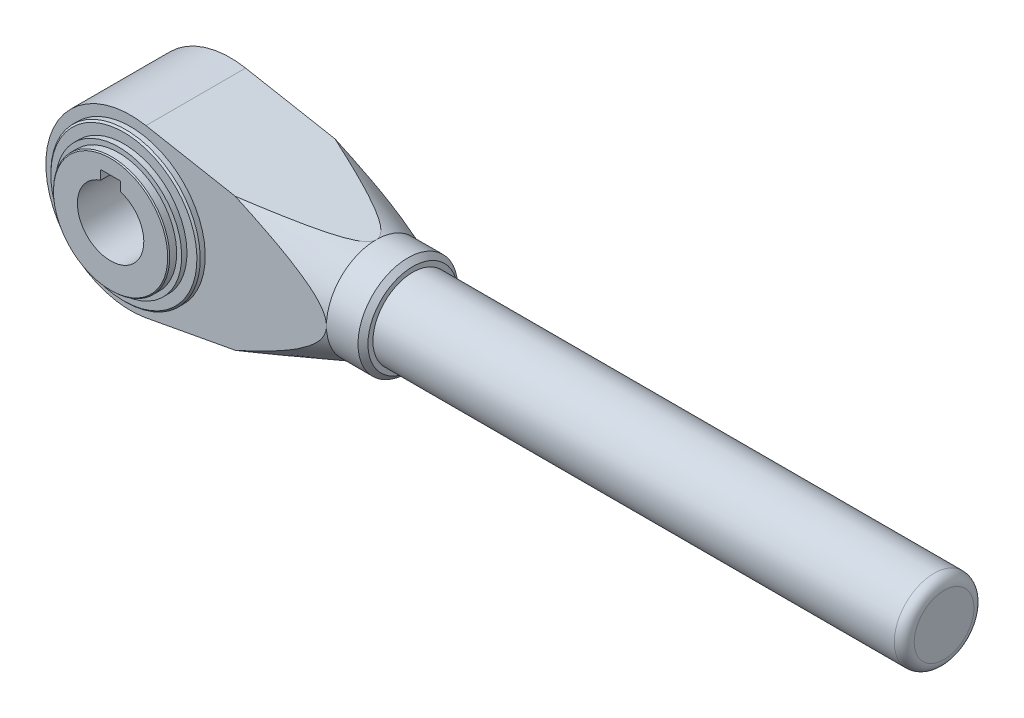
ISO-10303-21;
HEADER;
FILE_DESCRIPTION(('STEP AP214'),'2;1');
FILE_NAME('part.step','',(''),(''),'','','');
FILE_SCHEMA(('AUTOMOTIVE_DESIGN { 1 0 10303 214 1 1 1 1 }'));
ENDSEC;
DATA;
#1=APPLICATION_CONTEXT('core data for automotive mechanical design processes');
#2=APPLICATION_PROTOCOL_DEFINITION('international standard','automotive_design',2000,#1);
#3=PRODUCT_CONTEXT('',#1,'mechanical');
#4=PRODUCT('Part','Part','',(#3));
#5=PRODUCT_RELATED_PRODUCT_CATEGORY('part','',(#4));
#6=PRODUCT_DEFINITION_FORMATION('','',#4);
#7=PRODUCT_DEFINITION_CONTEXT('part definition',#1,'design');
#8=PRODUCT_DEFINITION('design','',#6,#7);
#9=PRODUCT_DEFINITION_SHAPE('','',#8);
#10=(LENGTH_UNIT() NAMED_UNIT(*) SI_UNIT(.MILLI.,.METRE.));
#11=(NAMED_UNIT(*) PLANE_ANGLE_UNIT() SI_UNIT($,.RADIAN.));
#12=(NAMED_UNIT(*) SI_UNIT($,.STERADIAN.) SOLID_ANGLE_UNIT());
#13=UNCERTAINTY_MEASURE_WITH_UNIT(LENGTH_MEASURE(1.E-05),#10,'distance_accuracy_value','');
#14=(GEOMETRIC_REPRESENTATION_CONTEXT(3) GLOBAL_UNCERTAINTY_ASSIGNED_CONTEXT((#13)) GLOBAL_UNIT_ASSIGNED_CONTEXT((#10,
#11,#12)) REPRESENTATION_CONTEXT('',''));
#15=CARTESIAN_POINT('',(0.,0.,0.));
#16=DIRECTION('',(0.,0.,1.));
#17=DIRECTION('',(1.,0.,0.));
#18=AXIS2_PLACEMENT_3D('',#15,#16,#17);
#19=CARTESIAN_POINT('',(59.,14.539392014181,36.));
#20=DIRECTION('',(-0.182222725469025,-0.983257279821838,0.));
#21=DIRECTION('',(0.983257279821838,-0.182222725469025,0.));
#22=AXIS2_PLACEMENT_3D('',#19,#20,#21);
#23=PLANE('',#22);
#24=CARTESIAN_POINT('',(31.577162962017,19.621545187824,5.9998));
#25=CARTESIAN_POINT('',(32.2805641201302,19.4911869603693,6.25675015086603));
#26=CARTESIAN_POINT('',(32.9834714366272,19.3609202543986,6.51510757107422));
#27=CARTESIAN_POINT('',(34.3880894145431,19.1006086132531,7.03521093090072));
#28=CARTESIAN_POINT('',(35.0898000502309,18.9705636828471,7.29695694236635));
#29=CARTESIAN_POINT('',(36.4926583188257,18.7105781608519,7.82472885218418));
#30=CARTESIAN_POINT('',(37.1938041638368,18.5806379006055,8.09075967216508));
#31=CARTESIAN_POINT('',(38.5943417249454,18.3210824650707,8.62754201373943));
#32=CARTESIAN_POINT('',(39.2937334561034,18.1914672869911,8.89829349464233));
#33=CARTESIAN_POINT('',(40.7207855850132,17.9269980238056,9.45740953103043));
#34=CARTESIAN_POINT('',(41.4483501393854,17.7921617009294,9.74602754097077));
#35=CARTESIAN_POINT('',(42.9004941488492,17.5230422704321,10.3309283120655));
#36=CARTESIAN_POINT('',(43.6250736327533,17.3887591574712,10.6272109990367));
#37=CARTESIAN_POINT('',(45.0697621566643,17.1210214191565,11.229228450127));
#38=CARTESIAN_POINT('',(45.7898742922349,16.9875662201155,11.5349555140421));
#39=CARTESIAN_POINT('',(47.2248306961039,16.7216320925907,12.1589185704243));
#40=CARTESIAN_POINT('',(47.9396752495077,16.5891531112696,12.4771538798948));
#41=CARTESIAN_POINT('',(49.0028900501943,16.3921122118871,12.9655749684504));
#42=CARTESIAN_POINT('',(49.354086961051,16.3270264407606,13.1293972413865));
#43=CARTESIAN_POINT('',(50.0542315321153,16.1972717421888,13.4619330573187));
#44=CARTESIAN_POINT('',(50.4031792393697,16.1326028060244,13.6306464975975));
#45=CARTESIAN_POINT('',(51.098826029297,16.0036816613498,13.9741515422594));
#46=CARTESIAN_POINT('',(51.4455209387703,15.9394302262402,14.1489519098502));
#47=CARTESIAN_POINT('',(52.1353701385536,15.8115835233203,14.5056026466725));
#48=CARTESIAN_POINT('',(52.4785246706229,15.7479882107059,14.6874525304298));
#49=CARTESIAN_POINT('',(53.1560832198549,15.6224192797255,15.0575656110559));
#50=CARTESIAN_POINT('',(53.4905429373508,15.5604353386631,15.245722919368));
#51=CARTESIAN_POINT('',(54.15345818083,15.4375801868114,15.6326607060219));
#52=CARTESIAN_POINT('',(54.4819144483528,15.376708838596,15.8314398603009));
#53=CARTESIAN_POINT('',(55.1297624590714,15.2566460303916,16.2422425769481));
#54=CARTESIAN_POINT('',(55.4491725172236,15.1974511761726,16.454236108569));
#55=CARTESIAN_POINT('',(56.0756748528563,15.0813442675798,16.896170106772));
#56=CARTESIAN_POINT('',(56.3827763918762,15.0244304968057,17.126096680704));
#57=CARTESIAN_POINT('',(56.7821748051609,14.950411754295,17.4515666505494));
#58=CARTESIAN_POINT('',(56.8830809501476,14.9317112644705,17.5361901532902));
#59=CARTESIAN_POINT('',(57.0821166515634,14.894824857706,17.708766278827));
#60=CARTESIAN_POINT('',(57.1802458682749,14.8766390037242,17.7967193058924));
#61=CARTESIAN_POINT('',(57.4700570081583,14.822929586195,18.066547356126));
#62=CARTESIAN_POINT('',(57.6567750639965,14.7883259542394,18.2540820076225));
#63=CARTESIAN_POINT('',(58.0118859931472,14.7225148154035,18.6501319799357));
#64=CARTESIAN_POINT('',(58.1800736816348,14.6913453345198,18.8588408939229));
#65=CARTESIAN_POINT('',(58.483313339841,14.6351472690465,19.3000585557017));
#66=CARTESIAN_POINT('',(58.6184745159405,14.610098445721,19.5324851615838));
#67=CARTESIAN_POINT('',(58.7932404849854,14.5777098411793,19.9261273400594));
#68=CARTESIAN_POINT('',(58.8495360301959,14.5672768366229,20.0795640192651));
#69=CARTESIAN_POINT('',(58.9370921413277,14.551050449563,20.393602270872));
#70=CARTESIAN_POINT('',(58.968398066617,14.5452486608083,20.5541903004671));
#71=CARTESIAN_POINT('',(59.0022105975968,14.5389823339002,20.8796153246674));
#72=CARTESIAN_POINT('',(59.0045343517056,14.5385516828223,21.0444727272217));
#73=CARTESIAN_POINT('',(58.9795676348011,14.5431786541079,21.3719174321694));
#74=CARTESIAN_POINT('',(58.9522464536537,14.5482419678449,21.5345022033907));
#75=CARTESIAN_POINT('',(58.8636065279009,14.5646692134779,21.8840803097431));
#76=CARTESIAN_POINT('',(58.7966420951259,14.5770794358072,22.069557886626));
#77=CARTESIAN_POINT('',(58.6346297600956,14.6071044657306,22.427240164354));
#78=CARTESIAN_POINT('',(58.5395281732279,14.6247292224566,22.5994186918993));
#79=CARTESIAN_POINT('',(58.341060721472,14.6615103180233,22.9123337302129));
#80=CARTESIAN_POINT('',(58.239742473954,14.6802871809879,23.054448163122));
#81=CARTESIAN_POINT('',(58.0255015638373,14.7199915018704,23.3294136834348));
#82=CARTESIAN_POINT('',(57.9125685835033,14.7409208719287,23.4622563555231));
#83=CARTESIAN_POINT('',(57.6777691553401,14.7844352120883,23.7202488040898));
#84=CARTESIAN_POINT('',(57.5558739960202,14.8070255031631,23.8453712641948));
#85=CARTESIAN_POINT('',(57.3056261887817,14.8534028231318,24.0885733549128));
#86=CARTESIAN_POINT('',(57.177276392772,14.8771893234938,24.2066560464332));
#87=CARTESIAN_POINT('',(56.8097998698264,14.9452921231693,24.5299644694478));
#88=CARTESIAN_POINT('',(56.5649824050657,14.9906630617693,24.7284861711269));
#89=CARTESIAN_POINT('',(56.0644989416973,15.0834154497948,25.1109469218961));
#90=CARTESIAN_POINT('',(55.8088254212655,15.1307982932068,25.2948755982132));
#91=CARTESIAN_POINT('',(55.2893599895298,15.2270685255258,25.6516795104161));
#92=CARTESIAN_POINT('',(55.0255516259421,15.275958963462,25.8245298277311));
#93=CARTESIAN_POINT('',(54.4923605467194,15.3747729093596,26.161110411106));
#94=CARTESIAN_POINT('',(54.2229771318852,15.4246965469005,26.3248395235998));
#95=CARTESIAN_POINT('',(53.6775692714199,15.5257745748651,26.6463095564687));
#96=CARTESIAN_POINT('',(53.401506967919,15.5769359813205,26.8039837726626));
#97=CARTESIAN_POINT('',(52.8460252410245,15.6798809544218,27.1131102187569));
#98=CARTESIAN_POINT('',(52.5666056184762,15.7316645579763,27.2645620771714));
#99=CARTESIAN_POINT('',(52.005514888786,15.8356490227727,27.562024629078));
#100=CARTESIAN_POINT('',(51.7238477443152,15.8878491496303,27.7080430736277));
#101=CARTESIAN_POINT('',(51.1583511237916,15.9926501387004,27.9956553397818));
#102=CARTESIAN_POINT('',(50.8745216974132,16.045250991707,28.1372492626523));
#103=CARTESIAN_POINT('',(50.1953300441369,16.1711225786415,28.47049093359));
#104=CARTESIAN_POINT('',(49.7991422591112,16.2445463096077,28.6603974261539));
#105=CARTESIAN_POINT('',(49.004042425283,16.391898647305,29.0342263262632));
#106=CARTESIAN_POINT('',(48.6051302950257,16.4658272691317,29.2181485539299));
#107=CARTESIAN_POINT('',(47.4050437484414,16.6882340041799,29.7624942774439));
#108=CARTESIAN_POINT('',(46.6005983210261,16.8373183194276,30.1154585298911));
#109=CARTESIAN_POINT('',(44.984817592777,17.1367638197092,30.8074013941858));
#110=CARTESIAN_POINT('',(44.1734751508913,17.2871263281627,31.1463626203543));
#111=CARTESIAN_POINT('',(42.5465123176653,17.5886441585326,31.8133225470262));
#112=CARTESIAN_POINT('',(41.7308921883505,17.739799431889,32.1413219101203));
#113=CARTESIAN_POINT('',(40.1392154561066,18.0347778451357,32.7718365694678));
#114=CARTESIAN_POINT('',(39.3633248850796,18.1785702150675,33.0747866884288));
#115=CARTESIAN_POINT('',(37.8092241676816,18.4665848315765,33.6745107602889));
#116=CARTESIAN_POINT('',(37.0310139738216,18.6108070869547,33.9712845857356));
#117=CARTESIAN_POINT('',(35.4743727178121,18.899292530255,34.5591531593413));
#118=CARTESIAN_POINT('',(34.6959455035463,19.0435550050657,34.8502584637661));
#119=CARTESIAN_POINT('',(33.1376006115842,19.3323561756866,35.4282156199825));
#120=CARTESIAN_POINT('',(32.3576829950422,19.4768948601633,35.7150676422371));
#121=CARTESIAN_POINT('',(31.5771629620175,19.621545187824,36.0002));
#122=B_SPLINE_CURVE_WITH_KNOTS('',3,(#24,#25,#26,#27,#28,#29,#30,#31,#32,#33,#34,#35,#36,#37,
#38,#39,#40,#41,#42,#43,#44,#45,#46,#47,#48,#49,#50,#51,#52,#53,#54,#55,#56,#57,#58,#59,#60,#61,
#62,#63,#64,#65,#66,#67,#68,#69,#70,#71,#72,#73,#74,#75,#76,#77,#78,#79,#80,#81,#82,#83,#84,#85,
#86,#87,#88,#89,#90,#91,#92,#93,#94,#95,#96,#97,#98,#99,#100,#101,#102,#103,#104,#105,#106,#107,
#108,#109,#110,#111,#112,#113,#114,#115,#116,#117,#118,#119,#120,#121),.UNSPECIFIED.,.F.,.F.,(4,
2,2,2,2,2,2,2,2,2,2,2,2,2,2,2,2,2,2,2,2,2,2,2,2,2,2,2,2,2,2,2,2,2,2,2,2,2,2,2,2,2,2,2,2,2,2,2,
4),(0.,2.28037767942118,4.560803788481,6.84406832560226,9.12731319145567,11.5100266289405,
13.8927170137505,16.2735135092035,18.654180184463,19.833014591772,21.0118242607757,
22.1924075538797,23.3729096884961,24.5389466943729,25.7048386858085,26.8681714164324,
28.0306117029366,28.4295916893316,28.8286202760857,29.6281770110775,30.4358473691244,
31.2408097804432,31.7303863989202,32.2190723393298,32.7108399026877,33.203117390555,
33.792553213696,34.3831209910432,34.908973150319,35.435296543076,35.9633864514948,
36.4912450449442,37.4457338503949,38.4008951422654,39.3581344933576,40.3154946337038,
41.2814225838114,42.2474081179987,43.211958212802,44.1764862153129,45.5127532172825,
46.8490603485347,49.521941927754,52.1980480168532,54.8739920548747,57.4097362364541,
59.9455326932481,62.4760388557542,65.0064433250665),.UNSPECIFIED.);
#123=CARTESIAN_POINT('',(31.57771051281,19.6214437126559,6.));
#124=VERTEX_POINT('',#123);
#125=CARTESIAN_POINT('',(59.,14.539392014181,21.));
#126=VERTEX_POINT('',#125);
#127=EDGE_CURVE('E189',#124,#126,#122,.T.);
#128=ORIENTED_EDGE('',*,*,#127,.F.);
#129=DIRECTION('',(-0.983257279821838,0.182222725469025,0.));
#130=VECTOR('',#129,1.);
#131=CARTESIAN_POINT('',(59.,14.539392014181,6.));
#132=LINE('',#131,#130);
#133=CARTESIAN_POINT('',(4.64667949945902,24.612452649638,6.));
#134=VERTEX_POINT('',#133);
#135=EDGE_CURVE('E391',#124,#134,#132,.T.);
#136=ORIENTED_EDGE('',*,*,#135,.T.);
#137=DIRECTION('',(0.,0.,-1.));
#138=VECTOR('',#137,1.);
#139=CARTESIAN_POINT('',(4.64667949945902,24.612452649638,36.));
#140=LINE('',#139,#138);
#141=CARTESIAN_POINT('',(4.64667949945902,24.612452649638,36.));
#142=VERTEX_POINT('',#141);
#143=EDGE_CURVE('E366',#142,#134,#140,.T.);
#144=ORIENTED_EDGE('',*,*,#143,.F.);
#145=DIRECTION('',(-0.983257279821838,0.182222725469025,0.));
#146=VECTOR('',#145,1.);
#147=CARTESIAN_POINT('',(59.,14.539392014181,36.));
#148=LINE('',#147,#146);
#149=CARTESIAN_POINT('',(31.57771051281,19.6214437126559,36.));
#150=VERTEX_POINT('',#149);
#151=EDGE_CURVE('E381',#150,#142,#148,.T.);
#152=ORIENTED_EDGE('',*,*,#151,.F.);
#153=EDGE_CURVE('E226',#126,#150,#122,.T.);
#154=ORIENTED_EDGE('',*,*,#153,.F.);
#155=EDGE_LOOP('',(#128,#136,#144,#152,#154));
#156=FACE_BOUND('',#155,.T.);
#157=ADVANCED_FACE('F15',(#156),#23,.F.);
#158=CARTESIAN_POINT('',(59.,-15.4606079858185,36.));
#159=DIRECTION('',(0.182222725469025,-0.983257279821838,0.));
#160=DIRECTION('',(0.983257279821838,0.182222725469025,0.));
#161=AXIS2_PLACEMENT_3D('',#158,#159,#160);
#162=PLANE('',#161);
#163=DIRECTION('',(-0.983257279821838,-0.182222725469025,0.));
#164=VECTOR('',#163,1.);
#165=CARTESIAN_POINT('',(59.,-15.4606079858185,6.));
#166=LINE('',#165,#164);
#167=CARTESIAN_POINT('',(31.5777105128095,-20.5426596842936,6.));
#168=VERTEX_POINT('',#167);
#169=CARTESIAN_POINT('',(4.64667949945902,-25.533668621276,6.));
#170=VERTEX_POINT('',#169);
#171=EDGE_CURVE('E384',#168,#170,#166,.T.);
#172=ORIENTED_EDGE('',*,*,#171,.F.);
#173=CARTESIAN_POINT('',(31.577162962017,-20.5427611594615,5.9998));
#174=CARTESIAN_POINT('',(32.2805641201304,-20.4124029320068,6.25675015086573));
#175=CARTESIAN_POINT('',(32.9834714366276,-20.282136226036,6.51510757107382));
#176=CARTESIAN_POINT('',(34.3880894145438,-20.0218245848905,7.0352109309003));
#177=CARTESIAN_POINT('',(35.0898000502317,-19.8917796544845,7.29695694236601));
#178=CARTESIAN_POINT('',(36.4926583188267,-19.6317941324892,7.82472885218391));
#179=CARTESIAN_POINT('',(37.1938041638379,-19.5018538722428,8.09075967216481));
#180=CARTESIAN_POINT('',(38.5943417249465,-19.242298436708,8.62754201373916));
#181=CARTESIAN_POINT('',(39.2937334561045,-19.1126832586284,8.89829349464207));
#182=CARTESIAN_POINT('',(40.7207855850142,-18.8482139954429,9.45740953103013));
#183=CARTESIAN_POINT('',(41.4483501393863,-18.7133776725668,9.7460275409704));
#184=CARTESIAN_POINT('',(42.9004941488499,-18.4442582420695,10.3309283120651));
#185=CARTESIAN_POINT('',(43.6250736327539,-18.3099751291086,10.6272109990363));
#186=CARTESIAN_POINT('',(45.0697621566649,-18.042237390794,11.2292284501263));
#187=CARTESIAN_POINT('',(45.7898742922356,-17.9087821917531,11.5349555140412));
#188=CARTESIAN_POINT('',(47.2248306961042,-17.642848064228,12.1589185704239));
#189=CARTESIAN_POINT('',(47.9396752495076,-17.5103690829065,12.4771538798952));
#190=CARTESIAN_POINT('',(49.0028900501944,-17.3133281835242,12.9655749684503));
#191=CARTESIAN_POINT('',(49.3540869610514,-17.248242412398,13.1293972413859));
#192=CARTESIAN_POINT('',(50.0542315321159,-17.1184877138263,13.4619330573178));
#193=CARTESIAN_POINT('',(50.4031792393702,-17.0538187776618,13.6306464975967));
#194=CARTESIAN_POINT('',(51.0988260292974,-16.9248976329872,13.9741515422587));
#195=CARTESIAN_POINT('',(51.4455209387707,-16.8606461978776,14.1489519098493));
#196=CARTESIAN_POINT('',(52.1353701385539,-16.7327994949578,14.5056026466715));
#197=CARTESIAN_POINT('',(52.4785246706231,-16.6692041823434,14.6874525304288));
#198=CARTESIAN_POINT('',(53.156083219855,-16.543635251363,15.0575656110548));
#199=CARTESIAN_POINT('',(53.4905429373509,-16.4816513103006,15.2457229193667));
#200=CARTESIAN_POINT('',(54.1534581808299,-16.358796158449,15.6326607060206));
#201=CARTESIAN_POINT('',(54.4819144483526,-16.2979248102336,15.8314398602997));
#202=CARTESIAN_POINT('',(55.1297624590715,-16.1778620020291,16.2422425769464));
#203=CARTESIAN_POINT('',(55.4491725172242,-16.1186671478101,16.4542361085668));
#204=CARTESIAN_POINT('',(56.075674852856,-16.0025602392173,16.8961701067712));
#205=CARTESIAN_POINT('',(56.3827763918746,-15.9456464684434,17.1260966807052));
#206=CARTESIAN_POINT('',(56.7821748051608,-15.8716277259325,17.4515666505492));
#207=CARTESIAN_POINT('',(56.8830809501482,-15.8529272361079,17.5361901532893));
#208=CARTESIAN_POINT('',(57.0821166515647,-15.8160408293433,17.7087662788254));
#209=CARTESIAN_POINT('',(57.1802458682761,-15.7978549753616,17.796719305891));
#210=CARTESIAN_POINT('',(57.470057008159,-15.7441455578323,18.0665473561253));
#211=CARTESIAN_POINT('',(57.6567750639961,-15.7095419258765,18.2540820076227));
#212=CARTESIAN_POINT('',(58.0118859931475,-15.6437307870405,18.6501319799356));
#213=CARTESIAN_POINT('',(58.1800736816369,-15.612561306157,18.8588408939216));
#214=CARTESIAN_POINT('',(58.483313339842,-15.5563632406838,19.3000585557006));
#215=CARTESIAN_POINT('',(58.6184745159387,-15.5313144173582,19.532485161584));
#216=CARTESIAN_POINT('',(58.7932404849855,-15.4989258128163,19.9261273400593));
#217=CARTESIAN_POINT('',(58.8495360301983,-15.4884928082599,20.0795640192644));
#218=CARTESIAN_POINT('',(58.9370921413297,-15.4722664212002,20.3936022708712));
#219=CARTESIAN_POINT('',(58.9683980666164,-15.4664646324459,20.5541903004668));
#220=CARTESIAN_POINT('',(59.0022105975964,-15.4601983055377,20.8796153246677));
#221=CARTESIAN_POINT('',(59.0045343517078,-15.4597676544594,21.044472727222));
#222=CARTESIAN_POINT('',(58.9795676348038,-15.4643946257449,21.3719174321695));
#223=CARTESIAN_POINT('',(58.9522464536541,-15.4694579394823,21.5345022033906));
#224=CARTESIAN_POINT('',(58.8636065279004,-15.4858851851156,21.8840803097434));
#225=CARTESIAN_POINT('',(58.7966420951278,-15.4982954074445,22.069557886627));
#226=CARTESIAN_POINT('',(58.6346297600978,-15.5283204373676,22.4272401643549));
#227=CARTESIAN_POINT('',(58.5395281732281,-15.5459451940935,22.5994186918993));
#228=CARTESIAN_POINT('',(58.3410607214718,-15.5827262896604,22.9123337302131));
#229=CARTESIAN_POINT('',(58.239742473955,-15.6015031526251,23.0544481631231));
#230=CARTESIAN_POINT('',(58.025501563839,-15.6412074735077,23.3294136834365));
#231=CARTESIAN_POINT('',(57.9125685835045,-15.6621368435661,23.4622563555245));
#232=CARTESIAN_POINT('',(57.6777691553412,-15.7056511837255,23.7202488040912));
#233=CARTESIAN_POINT('',(57.5558739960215,-15.7282414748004,23.8453712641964));
#234=CARTESIAN_POINT('',(57.3056261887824,-15.7746187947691,24.0885733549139));
#235=CARTESIAN_POINT('',(57.1772763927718,-15.7984052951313,24.2066560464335));
#236=CARTESIAN_POINT('',(56.8097998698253,-15.866508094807,24.5299644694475));
#237=CARTESIAN_POINT('',(56.5649824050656,-15.9118790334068,24.728486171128));
#238=CARTESIAN_POINT('',(56.0644989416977,-16.0046314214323,25.1109469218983));
#239=CARTESIAN_POINT('',(55.8088254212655,-16.0520142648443,25.294875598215));
#240=CARTESIAN_POINT('',(55.2893599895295,-16.1482844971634,25.6516795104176));
#241=CARTESIAN_POINT('',(55.0255516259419,-16.1971749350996,25.8245298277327));
#242=CARTESIAN_POINT('',(54.4923605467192,-16.2959888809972,26.1611104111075));
#243=CARTESIAN_POINT('',(54.2229771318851,-16.345912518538,26.3248395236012));
#244=CARTESIAN_POINT('',(53.6775692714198,-16.4469905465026,26.64630955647));
#245=CARTESIAN_POINT('',(53.4015069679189,-16.498151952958,26.8039837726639));
#246=CARTESIAN_POINT('',(52.8460252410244,-16.6010969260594,27.1131102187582));
#247=CARTESIAN_POINT('',(52.5666056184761,-16.6528805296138,27.2645620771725));
#248=CARTESIAN_POINT('',(52.005514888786,-16.7568649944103,27.5620246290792));
#249=CARTESIAN_POINT('',(51.7238477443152,-16.809065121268,27.7080430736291));
#250=CARTESIAN_POINT('',(51.1583511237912,-16.9138661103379,27.9956553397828));
#251=CARTESIAN_POINT('',(50.8745216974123,-16.9664669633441,28.1372492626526));
#252=CARTESIAN_POINT('',(50.1953300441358,-17.0923385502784,28.4704909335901));
#253=CARTESIAN_POINT('',(49.7991422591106,-17.1657622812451,28.6603974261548));
#254=CARTESIAN_POINT('',(49.0040424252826,-17.3131146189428,29.0342263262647));
#255=CARTESIAN_POINT('',(48.6051302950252,-17.3870432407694,29.2181485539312));
#256=CARTESIAN_POINT('',(47.4050437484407,-17.6094499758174,29.7624942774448));
#257=CARTESIAN_POINT('',(46.6005983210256,-17.7585342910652,30.1154585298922));
#258=CARTESIAN_POINT('',(44.9848175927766,-18.0579797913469,30.8074013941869));
#259=CARTESIAN_POINT('',(44.173475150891,-18.2083422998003,31.1463626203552));
#260=CARTESIAN_POINT('',(42.5465123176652,-18.5098601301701,31.8133225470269));
#261=CARTESIAN_POINT('',(41.7308921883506,-18.6610154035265,32.141321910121));
#262=CARTESIAN_POINT('',(40.1392154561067,-18.9559938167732,32.7718365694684));
#263=CARTESIAN_POINT('',(39.3633248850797,-19.0997861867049,33.0747866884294));
#264=CARTESIAN_POINT('',(37.8092241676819,-19.387800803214,33.6745107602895));
#265=CARTESIAN_POINT('',(37.0310139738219,-19.5320230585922,33.9712845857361));
#266=CARTESIAN_POINT('',(35.4743727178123,-19.8205085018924,34.5591531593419));
#267=CARTESIAN_POINT('',(34.6959455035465,-19.9647709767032,34.8502584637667));
#268=CARTESIAN_POINT('',(33.1376006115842,-20.2535721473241,35.428215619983));
#269=CARTESIAN_POINT('',(32.357682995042,-20.3981108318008,35.7150676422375));
#270=CARTESIAN_POINT('',(31.577162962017,-20.5427611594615,36.0002));
#271=B_SPLINE_CURVE_WITH_KNOTS('',3,(#173,#174,#175,#176,#177,#178,#179,#180,#181,#182,#183,
#184,#185,#186,#187,#188,#189,#190,#191,#192,#193,#194,#195,#196,#197,#198,#199,#200,#201,#202,
#203,#204,#205,#206,#207,#208,#209,#210,#211,#212,#213,#214,#215,#216,#217,#218,#219,#220,#221,
#222,#223,#224,#225,#226,#227,#228,#229,#230,#231,#232,#233,#234,#235,#236,#237,#238,#239,#240,
#241,#242,#243,#244,#245,#246,#247,#248,#249,#250,#251,#252,#253,#254,#255,#256,#257,#258,#259,
#260,#261,#262,#263,#264,#265,#266,#267,#268,#269,#270),.UNSPECIFIED.,.F.,.F.,(4,2,2,2,2,2,2,2,
2,2,2,2,2,2,2,2,2,2,2,2,2,2,2,2,2,2,2,2,2,2,2,2,2,2,2,2,2,2,2,2,2,2,2,2,2,2,2,2,4),(0.,
2.28037767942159,4.56080378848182,6.84406832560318,9.12731319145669,11.5100266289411,
13.8927170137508,16.2735135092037,18.6541801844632,19.8330145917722,21.0118242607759,
22.1924075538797,23.3729096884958,24.5389466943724,25.7048386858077,26.8681714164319,
28.0306117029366,28.4295916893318,28.828620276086,29.6281770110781,30.4358473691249,
31.2408097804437,31.7303863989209,32.2190723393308,32.7108399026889,33.2031173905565,
33.7925532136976,34.383120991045,34.9089731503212,35.4352965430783,35.963386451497,
36.4912450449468,37.4457338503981,38.4008951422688,39.3581344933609,40.3154946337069,
41.2814225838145,42.2474081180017,43.2119582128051,44.1764862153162,45.5127532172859,
46.8490603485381,49.5219419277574,52.1980480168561,54.8739920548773,57.4097362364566,
59.9455326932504,62.4760388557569,65.0064433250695),.UNSPECIFIED.);
#272=CARTESIAN_POINT('',(59.,-15.4606079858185,21.));
#273=VERTEX_POINT('',#272);
#274=EDGE_CURVE('E181',#168,#273,#271,.T.);
#275=ORIENTED_EDGE('',*,*,#274,.T.);
#276=CARTESIAN_POINT('',(31.5777105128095,-20.5426596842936,36.));
#277=VERTEX_POINT('',#276);
#278=EDGE_CURVE('E190',#273,#277,#271,.T.);
#279=ORIENTED_EDGE('',*,*,#278,.T.);
#280=DIRECTION('',(-0.983257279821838,-0.182222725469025,0.));
#281=VECTOR('',#280,1.);
#282=CARTESIAN_POINT('',(59.,-15.4606079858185,36.));
#283=LINE('',#282,#281);
#284=CARTESIAN_POINT('',(4.64667949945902,-25.533668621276,36.));
#285=VERTEX_POINT('',#284);
#286=EDGE_CURVE('E374',#277,#285,#283,.T.);
#287=ORIENTED_EDGE('',*,*,#286,.T.);
#288=DIRECTION('',(0.,0.,-1.));
#289=VECTOR('',#288,1.);
#290=CARTESIAN_POINT('',(4.64667949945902,-25.533668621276,36.));
#291=LINE('',#290,#289);
#292=EDGE_CURVE('E370',#285,#170,#291,.T.);
#293=ORIENTED_EDGE('',*,*,#292,.T.);
#294=EDGE_LOOP('',(#172,#275,#279,#287,#293));
#295=FACE_BOUND('',#294,.T.);
#296=ADVANCED_FACE('F197',(#295),#162,.T.);
#297=CARTESIAN_POINT('',(0.,-0.460607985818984,36.));
#298=DIRECTION('',(0.,0.,1.));
#299=DIRECTION('',(1.,0.,0.));
#300=AXIS2_PLACEMENT_3D('',#297,#298,#299);
#301=PLANE('',#300);
#302=CARTESIAN_POINT('',(0.,-0.460607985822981,36.));
#303=DIRECTION('',(0.,0.,1.));
#304=DIRECTION('',(0.,-1.,0.));
#305=AXIS2_PLACEMENT_3D('',#302,#303,#304);
#306=CIRCLE('',#305,22.5);
#307=CARTESIAN_POINT('',(0.,-22.960607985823,36.0000000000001));
#308=VERTEX_POINT('',#307);
#309=EDGE_CURVE('E449',#308,#308,#306,.T.);
#310=ORIENTED_EDGE('',*,*,#309,.F.);
#311=EDGE_LOOP('',(#310));
#312=FACE_BOUND('',#311,.T.);
#313=ORIENTED_EDGE('',*,*,#286,.F.);
#314=CARTESIAN_POINT('',(-16.548339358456,-40.4722825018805,36.));
#315=CARTESIAN_POINT('',(-14.9112805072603,-39.8305171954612,36.));
#316=CARTESIAN_POINT('',(-13.2748509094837,-39.18714235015,36.));
#317=CARTESIAN_POINT('',(-10.0034930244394,-37.8965676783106,36.));
#318=CARTESIAN_POINT('',(-8.36856474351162,-37.2493678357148,36.));
#319=CARTESIAN_POINT('',(-5.1002670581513,-35.9504635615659,36.));
#320=CARTESIAN_POINT('',(-3.46689786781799,-35.298758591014,36.));
#321=CARTESIAN_POINT('',(-0.202249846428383,-33.9901381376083,36.));
#322=CARTESIAN_POINT('',(1.42902898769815,-33.3332226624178,36.));
#323=CARTESIAN_POINT('',(4.6904863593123,-32.0126349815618,36.));
#324=CARTESIAN_POINT('',(6.32066273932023,-31.3489574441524,36.));
#325=CARTESIAN_POINT('',(9.57796157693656,-30.0141514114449,36.));
#326=CARTESIAN_POINT('',(11.2050840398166,-29.3430229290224,36.));
#327=CARTESIAN_POINT('',(14.4554777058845,-27.991714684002,36.));
#328=CARTESIAN_POINT('',(16.0787490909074,-27.3115353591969,36.));
#329=CARTESIAN_POINT('',(19.3205316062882,-25.9399370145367,36.));
#330=CARTESIAN_POINT('',(20.939042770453,-25.2485180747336,36.));
#331=CARTESIAN_POINT('',(23.9270021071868,-23.9564983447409,36.));
#332=CARTESIAN_POINT('',(25.2973048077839,-23.3578753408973,36.));
#333=CARTESIAN_POINT('',(28.0323116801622,-22.1478595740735,36.));
#334=CARTESIAN_POINT('',(29.3970157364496,-21.5364665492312,36.));
#335=CARTESIAN_POINT('',(31.4386129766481,-20.6071798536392,36.));
#336=CARTESIAN_POINT('',(32.1182750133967,-20.295366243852,36.));
#337=CARTESIAN_POINT('',(33.4754546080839,-19.6671093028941,36.));
#338=CARTESIAN_POINT('',(34.1529721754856,-19.3506659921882,36.));
#339=CARTESIAN_POINT('',(35.5054881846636,-18.7124909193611,36.));
#340=CARTESIAN_POINT('',(36.1804867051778,-18.3907593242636,36.));
#341=CARTESIAN_POINT('',(37.5275310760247,-17.74117987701,36.));
#342=CARTESIAN_POINT('',(38.1995769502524,-17.4133320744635,36.));
#343=CARTESIAN_POINT('',(39.55176304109,-16.7447647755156,36.));
#344=CARTESIAN_POINT('',(40.2318417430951,-16.4039206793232,36.));
#345=CARTESIAN_POINT('',(41.5875801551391,-15.7135141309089,36.));
#346=CARTESIAN_POINT('',(42.2632398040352,-15.3639515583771,36.));
#347=CARTESIAN_POINT('',(43.6086062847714,-14.6546491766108,36.));
#348=CARTESIAN_POINT('',(44.2783169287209,-14.2949166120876,36.));
#349=CARTESIAN_POINT('',(45.6108047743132,-13.5628356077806,36.));
#350=CARTESIAN_POINT('',(46.2735822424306,-13.1904876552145,36.));
#351=CARTESIAN_POINT('',(47.3660236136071,-12.5595941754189,36.));
#352=CARTESIAN_POINT('',(47.7982341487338,-12.3054600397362,36.));
#353=CARTESIAN_POINT('',(48.6578977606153,-11.789277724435,36.));
#354=CARTESIAN_POINT('',(49.0853509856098,-11.5272297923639,36.));
#355=CARTESIAN_POINT('',(49.9352410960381,-10.9933247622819,36.));
#356=CARTESIAN_POINT('',(50.3576668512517,-10.7214498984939,36.));
#357=CARTESIAN_POINT('',(51.1951651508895,-10.1666177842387,36.));
#358=CARTESIAN_POINT('',(51.6102382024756,-9.88366130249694,36.));
#359=CARTESIAN_POINT('',(52.4385297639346,-9.29906298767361,36.));
#360=CARTESIAN_POINT('',(52.8515740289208,-8.99717333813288,36.));
#361=CARTESIAN_POINT('',(53.6649730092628,-8.37627705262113,36.));
#362=CARTESIAN_POINT('',(54.0653230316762,-8.05726420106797,36.));
#363=CARTESIAN_POINT('',(54.6519484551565,-7.56336485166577,36.));
#364=CARTESIAN_POINT('',(54.8449131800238,-7.39641283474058,36.));
#365=CARTESIAN_POINT('',(55.2255593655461,-7.05660366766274,36.));
#366=CARTESIAN_POINT('',(55.4132413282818,-6.88374708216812,36.));
#367=CARTESIAN_POINT('',(55.7821624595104,-6.53151627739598,36.));
#368=CARTESIAN_POINT('',(55.9634059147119,-6.35214656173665,36.));
#369=CARTESIAN_POINT('',(56.3182073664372,-5.98599034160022,36.));
#370=CARTESIAN_POINT('',(56.4917668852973,-5.79920532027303,36.));
#371=CARTESIAN_POINT('',(56.8034068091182,-5.44678967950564,36.));
#372=CARTESIAN_POINT('',(56.9428270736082,-5.28234680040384,36.));
#373=CARTESIAN_POINT('',(57.2136130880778,-4.94692986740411,36.));
#374=CARTESIAN_POINT('',(57.3449789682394,-4.77595591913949,36.));
#375=CARTESIAN_POINT('',(57.5981923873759,-4.42667231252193,36.));
#376=CARTESIAN_POINT('',(57.7200255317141,-4.24835215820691,36.));
#377=CARTESIAN_POINT('',(57.9519203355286,-3.88415357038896,36.));
#378=CARTESIAN_POINT('',(58.0619814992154,-3.69827481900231,36.));
#379=CARTESIAN_POINT('',(58.2696718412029,-3.31541698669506,36.));
#380=CARTESIAN_POINT('',(58.3670506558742,-3.11830083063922,36.));
#381=CARTESIAN_POINT('',(58.544062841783,-2.71627499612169,36.));
#382=CARTESIAN_POINT('',(58.6237040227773,-2.51136879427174,36.));
#383=CARTESIAN_POINT('',(58.7618820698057,-2.09529912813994,36.));
#384=CARTESIAN_POINT('',(58.8204941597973,-1.88416095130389,36.));
#385=CARTESIAN_POINT('',(58.9141022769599,-1.4566975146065,36.));
#386=CARTESIAN_POINT('',(58.9491064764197,-1.24037407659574,36.));
#387=CARTESIAN_POINT('',(58.9904984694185,-0.834740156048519,36.));
#388=CARTESIAN_POINT('',(59.0001314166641,-0.645758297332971,36.));
#389=CARTESIAN_POINT('',(58.9998659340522,-0.267818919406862,36.));
#390=CARTESIAN_POINT('',(58.9899695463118,-0.0788613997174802,36.));
#391=CARTESIAN_POINT('',(58.9510739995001,0.297342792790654,36.));
#392=CARTESIAN_POINT('',(58.9220458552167,0.484586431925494,36.));
#393=CARTESIAN_POINT('',(58.8461223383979,0.855401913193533,36.));
#394=CARTESIAN_POINT('',(58.799223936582,1.03897312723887,36.));
#395=CARTESIAN_POINT('',(58.6818399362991,1.42593002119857,36.));
#396=CARTESIAN_POINT('',(58.6090086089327,1.62860031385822,36.));
#397=CARTESIAN_POINT('',(58.4454935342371,2.02662858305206,36.));
#398=CARTESIAN_POINT('',(58.3548009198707,2.22198287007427,36.));
#399=CARTESIAN_POINT('',(58.1583574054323,2.60516378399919,36.));
#400=CARTESIAN_POINT('',(58.0525905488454,2.7929821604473,36.));
#401=CARTESIAN_POINT('',(57.8286329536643,3.16099179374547,36.));
#402=CARTESIAN_POINT('',(57.7104424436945,3.34118319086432,36.));
#403=CARTESIAN_POINT('',(57.4428642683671,3.72430995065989,36.));
#404=CARTESIAN_POINT('',(57.2915853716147,3.92591896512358,36.));
#405=CARTESIAN_POINT('',(56.9777073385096,4.32016514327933,36.));
#406=CARTESIAN_POINT('',(56.8151042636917,4.51279914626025,36.));
#407=CARTESIAN_POINT('',(56.4805428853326,4.89019196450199,36.));
#408=CARTESIAN_POINT('',(56.3085721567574,5.0749397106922,36.));
#409=CARTESIAN_POINT('',(55.9571345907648,5.43717060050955,36.));
#410=CARTESIAN_POINT('',(55.7776668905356,5.61465290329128,36.));
#411=CARTESIAN_POINT('',(55.4113602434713,5.96426539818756,36.));
#412=CARTESIAN_POINT('',(55.2244807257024,6.13635293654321,36.));
#413=CARTESIAN_POINT('',(54.8455006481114,6.47467010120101,36.));
#414=CARTESIAN_POINT('',(54.6533999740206,6.64089959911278,36.));
#415=CARTESIAN_POINT('',(54.2649827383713,6.96797507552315,36.));
#416=CARTESIAN_POINT('',(54.0686702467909,7.12882589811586,36.));
#417=CARTESIAN_POINT('',(53.6723155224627,7.4458396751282,36.));
#418=CARTESIAN_POINT('',(53.4722733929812,7.60200275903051,36.));
#419=CARTESIAN_POINT('',(52.8548217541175,8.07377935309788,36.));
#420=CARTESIAN_POINT('',(52.4322029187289,8.38258625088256,36.));
#421=CARTESIAN_POINT('',(51.5767646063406,8.98578659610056,36.));
#422=CARTESIAN_POINT('',(51.1439431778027,9.28017725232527,36.));
#423=CARTESIAN_POINT('',(50.2701482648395,9.85722702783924,36.));
#424=CARTESIAN_POINT('',(49.8291694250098,10.1398780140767,36.));
#425=CARTESIAN_POINT('',(48.9410205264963,10.6951767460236,36.));
#426=CARTESIAN_POINT('',(48.493850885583,10.9678251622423,36.));
#427=CARTESIAN_POINT('',(47.5933088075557,11.50537359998,36.));
#428=CARTESIAN_POINT('',(47.1399232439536,11.7702515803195,36.));
#429=CARTESIAN_POINT('',(46.2289877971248,12.2927476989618,36.));
#430=CARTESIAN_POINT('',(45.7714378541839,12.5503657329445,36.));
#431=CARTESIAN_POINT('',(44.8530402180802,13.0592343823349,36.));
#432=CARTESIAN_POINT('',(44.3921938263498,13.3104873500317,36.));
#433=CARTESIAN_POINT('',(43.467561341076,13.8075300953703,36.));
#434=CARTESIAN_POINT('',(43.0037752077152,14.053319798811,36.));
#435=CARTESIAN_POINT('',(41.6049206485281,14.7854847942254,36.));
#436=CARTESIAN_POINT('',(40.666059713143,15.2646192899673,36.));
#437=CARTESIAN_POINT('',(38.780738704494,16.207815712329,36.));
#438=CARTESIAN_POINT('',(37.8342780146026,16.6718764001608,36.));
#439=CARTESIAN_POINT('',(35.9370616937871,17.5870897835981,36.));
#440=CARTESIAN_POINT('',(34.9863156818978,18.0382624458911,36.));
#441=CARTESIAN_POINT('',(33.5567363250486,18.707565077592,36.));
#442=CARTESIAN_POINT('',(33.0796405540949,18.9294198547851,36.));
#443=CARTESIAN_POINT('',(32.1244011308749,19.3708624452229,36.));
#444=CARTESIAN_POINT('',(31.646257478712,19.590450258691,36.));
#445=CARTESIAN_POINT('',(30.2011574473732,20.2503442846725,36.));
#446=CARTESIAN_POINT('',(29.2327501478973,20.6874747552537,36.));
#447=CARTESIAN_POINT('',(27.2927733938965,21.5546682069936,36.));
#448=CARTESIAN_POINT('',(26.3212039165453,21.9847311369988,36.));
#449=CARTESIAN_POINT('',(24.3754022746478,22.8388538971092,36.));
#450=CARTESIAN_POINT('',(23.4011700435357,23.2629135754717,36.));
#451=CARTESIAN_POINT('',(21.4504704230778,24.1058631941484,36.));
#452=CARTESIAN_POINT('',(20.4740030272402,24.5247531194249,36.));
#453=CARTESIAN_POINT('',(17.5415494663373,25.7748217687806,36.));
#454=CARTESIAN_POINT('',(15.5827115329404,26.5993121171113,36.));
#455=CARTESIAN_POINT('',(11.6593495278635,28.2346507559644,36.));
#456=CARTESIAN_POINT('',(9.69482542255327,29.0454989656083,36.));
#457=CARTESIAN_POINT('',(6.74359923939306,30.2541598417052,36.));
#458=CARTESIAN_POINT('',(5.75854719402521,30.6560080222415,36.));
#459=CARTESIAN_POINT('',(3.78746223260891,31.4572815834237,36.));
#460=CARTESIAN_POINT('',(2.80142932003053,31.8567069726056,36.));
#461=CARTESIAN_POINT('',(-0.157988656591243,33.0517390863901,36.));
#462=CARTESIAN_POINT('',(-2.13268524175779,33.8440986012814,36.));
#463=CARTESIAN_POINT('',(-6.0847633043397,35.4217127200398,36.));
#464=CARTESIAN_POINT('',(-8.06214459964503,36.2069677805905,36.));
#465=CARTESIAN_POINT('',(-12.0192136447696,37.7716366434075,36.));
#466=CARTESIAN_POINT('',(-13.9989013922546,38.5510504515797,36.));
#467=CARTESIAN_POINT('',(-17.866977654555,40.0684192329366,36.));
#468=CARTESIAN_POINT('',(-19.755278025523,40.8065990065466,36.));
#469=CARTESIAN_POINT('',(-23.5333583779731,42.2791630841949,36.));
#470=CARTESIAN_POINT('',(-25.4231383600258,43.0135473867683,36.));
#471=CARTESIAN_POINT('',(-31.0944411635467,45.2118570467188,36.));
#472=CARTESIAN_POINT('',(-34.8778529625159,46.6709102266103,36.));
#473=CARTESIAN_POINT('',(-40.552672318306,48.8509212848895,36.));
#474=CARTESIAN_POINT('',(-42.4426653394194,49.5755674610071,36.));
#475=CARTESIAN_POINT('',(-46.2234815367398,51.0226921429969,36.));
#476=CARTESIAN_POINT('',(-48.1143047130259,51.7451706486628,36.));
#477=CARTESIAN_POINT('',(-51.8966314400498,53.1881997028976,36.));
#478=CARTESIAN_POINT('',(-53.7881349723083,53.9087502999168,36.));
#479=CARTESIAN_POINT('',(-57.5717893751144,55.3481478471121,36.));
#480=CARTESIAN_POINT('',(-59.4639402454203,56.0669947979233,36.));
#481=CARTESIAN_POINT('',(-61.3563749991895,56.7850931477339,36.));
#482=B_SPLINE_CURVE_WITH_KNOTS('',3,(#314,#315,#316,#317,#318,#319,#320,#321,#322,#323,#324,
#325,#326,#327,#328,#329,#330,#331,#332,#333,#334,#335,#336,#337,#338,#339,#340,#341,#342,#343,
#344,#345,#346,#347,#348,#349,#350,#351,#352,#353,#354,#355,#356,#357,#358,#359,#360,#361,#362,
#363,#364,#365,#366,#367,#368,#369,#370,#371,#372,#373,#374,#375,#376,#377,#378,#379,#380,#381,
#382,#383,#384,#385,#386,#387,#388,#389,#390,#391,#392,#393,#394,#395,#396,#397,#398,#399,#400,
#401,#402,#403,#404,#405,#406,#407,#408,#409,#410,#411,#412,#413,#414,#415,#416,#417,#418,#419,
#420,#421,#422,#423,#424,#425,#426,#427,#428,#429,#430,#431,#432,#433,#434,#435,#436,#437,#438,
#439,#440,#441,#442,#443,#444,#445,#446,#447,#448,#449,#450,#451,#452,#453,#454,#455,#456,#457,
#458,#459,#460,#461,#462,#463,#464,#465,#466,#467,#468,#469,#470,#471,#472,#473,#474,#475,#476,
#477,#478,#479,#480,#481),.UNSPECIFIED.,.F.,.F.,(4,2,2,2,2,2,2,2,2,2,2,2,2,2,2,2,2,2,2,2,2,2,2,
2,2,2,2,2,2,2,2,2,2,2,2,2,2,2,2,2,2,2,2,2,2,2,2,2,2,2,2,2,2,2,2,2,2,2,2,2,2,2,2,2,2,2,2,2,2,2,2,
2,2,2,2,2,2,2,2,2,2,2,2,4),(0.,5.27507684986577,10.5501758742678,15.8259173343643,
21.1016510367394,26.3819282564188,31.66219635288,36.9422099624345,42.2221859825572,
46.7081965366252,51.194299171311,53.4376118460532,55.6809146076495,57.9241466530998,
60.1673605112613,62.4494425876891,64.7315561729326,67.0120831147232,69.2925220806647,
70.7966184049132,72.3006677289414,73.8075874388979,75.3144027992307,76.8489078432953,
78.3839737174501,79.1493664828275,79.9146862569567,80.6794865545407,81.4441346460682,
82.0906971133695,82.7372491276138,83.3847593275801,84.0322967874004,84.6911302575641,
85.3496730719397,86.0058361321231,86.6617719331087,87.2284743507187,87.7951175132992,
88.3626211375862,88.9302210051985,89.5752929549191,90.2206859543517,90.8667672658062,
91.5128366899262,92.2684907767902,93.0244089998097,93.7813554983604,94.5383893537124,
95.3003801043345,96.0623875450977,96.823689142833,97.5849696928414,99.154798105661,
100.724929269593,102.296130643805,103.867226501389,105.442416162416,107.01762844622,
108.59224983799,110.166892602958,113.32885557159,116.49107774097,119.648101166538,
121.226564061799,122.805026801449,125.992474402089,129.179945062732,132.367496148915,
135.555056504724,141.930830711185,148.306642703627,151.498236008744,154.689818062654,
161.073007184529,167.455783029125,173.838552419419,179.92092296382,186.003295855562,
198.168279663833,204.240730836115,210.313182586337,216.385480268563,222.457775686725),.UNSPECIFIED.);
#483=CARTESIAN_POINT('',(59.,-0.460607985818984,36.));
#484=VERTEX_POINT('',#483);
#485=EDGE_CURVE('E225',#277,#484,#482,.T.);
#486=ORIENTED_EDGE('',*,*,#485,.T.);
#487=EDGE_CURVE('E217',#484,#150,#482,.T.);
#488=ORIENTED_EDGE('',*,*,#487,.T.);
#489=ORIENTED_EDGE('',*,*,#151,.T.);
#490=CARTESIAN_POINT('',(0.,-0.460607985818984,36.));
#491=DIRECTION('',(0.,0.,1.));
#492=DIRECTION('',(1.,0.,0.));
#493=AXIS2_PLACEMENT_3D('',#490,#491,#492);
#494=CIRCLE('',#493,25.5);
#495=EDGE_CURVE('E377',#142,#285,#494,.T.);
#496=ORIENTED_EDGE('',*,*,#495,.T.);
#497=EDGE_LOOP('',(#313,#486,#488,#489,#496));
#498=FACE_BOUND('',#497,.T.);
#499=ADVANCED_FACE('F229',(#312,#498),#301,.T.);
#500=CARTESIAN_POINT('',(0.,-0.460607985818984,6.));
#501=DIRECTION('',(0.,0.,1.));
#502=DIRECTION('',(1.,0.,0.));
#503=AXIS2_PLACEMENT_3D('',#500,#501,#502);
#504=PLANE('',#503);
#505=CARTESIAN_POINT('',(0.,-0.460607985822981,6.));
#506=DIRECTION('',(0.,0.,1.));
#507=DIRECTION('',(0.,-1.,0.));
#508=AXIS2_PLACEMENT_3D('',#505,#506,#507);
#509=CIRCLE('',#508,22.5);
#510=CARTESIAN_POINT('',(0.,-22.960607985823,6.00000000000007));
#511=VERTEX_POINT('',#510);
#512=EDGE_CURVE('E227',#511,#511,#509,.T.);
#513=ORIENTED_EDGE('',*,*,#512,.T.);
#514=EDGE_LOOP('',(#513));
#515=FACE_BOUND('',#514,.T.);
#516=CARTESIAN_POINT('',(-16.548339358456,-40.4722825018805,6.));
#517=CARTESIAN_POINT('',(-14.9112805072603,-39.8305171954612,6.));
#518=CARTESIAN_POINT('',(-13.2748509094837,-39.18714235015,6.));
#519=CARTESIAN_POINT('',(-10.0034930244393,-37.8965676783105,6.));
#520=CARTESIAN_POINT('',(-8.36856474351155,-37.2493678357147,6.));
#521=CARTESIAN_POINT('',(-5.1002670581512,-35.9504635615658,6.));
#522=CARTESIAN_POINT('',(-3.46689786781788,-35.2987585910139,6.));
#523=CARTESIAN_POINT('',(-0.202249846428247,-33.9901381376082,6.));
#524=CARTESIAN_POINT('',(1.4290289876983,-33.3332226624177,6.));
#525=CARTESIAN_POINT('',(4.69048635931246,-32.0126349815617,6.));
#526=CARTESIAN_POINT('',(6.3206627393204,-31.3489574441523,6.));
#527=CARTESIAN_POINT('',(9.57796157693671,-30.0141514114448,6.));
#528=CARTESIAN_POINT('',(11.2050840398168,-29.3430229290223,6.));
#529=CARTESIAN_POINT('',(14.4554777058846,-27.9917146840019,6.));
#530=CARTESIAN_POINT('',(16.0787490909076,-27.3115353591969,6.));
#531=CARTESIAN_POINT('',(19.3205316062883,-25.9399370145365,6.));
#532=CARTESIAN_POINT('',(20.939042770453,-25.2485180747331,6.));
#533=CARTESIAN_POINT('',(23.9270021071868,-23.9564983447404,6.));
#534=CARTESIAN_POINT('',(25.2973048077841,-23.3578753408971,6.));
#535=CARTESIAN_POINT('',(28.0323116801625,-22.1478595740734,6.));
#536=CARTESIAN_POINT('',(29.39701573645,-21.5364665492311,6.));
#537=CARTESIAN_POINT('',(31.4386129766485,-20.607179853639,6.));
#538=CARTESIAN_POINT('',(32.1182750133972,-20.2953662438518,6.));
#539=CARTESIAN_POINT('',(33.4754546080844,-19.6671093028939,6.));
#540=CARTESIAN_POINT('',(34.152972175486,-19.350665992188,6.));
#541=CARTESIAN_POINT('',(35.5054881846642,-18.7124909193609,6.));
#542=CARTESIAN_POINT('',(36.1804867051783,-18.3907593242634,6.));
#543=CARTESIAN_POINT('',(37.5275310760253,-17.7411798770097,6.));
#544=CARTESIAN_POINT('',(38.1995769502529,-17.413332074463,6.));
#545=CARTESIAN_POINT('',(39.5517630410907,-16.744764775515,6.));
#546=CARTESIAN_POINT('',(40.231841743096,-16.4039206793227,6.));
#547=CARTESIAN_POINT('',(41.5875801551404,-15.7135141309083,6.));
#548=CARTESIAN_POINT('',(42.2632398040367,-15.3639515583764,6.));
#549=CARTESIAN_POINT('',(43.6086062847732,-14.6546491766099,6.));
#550=CARTESIAN_POINT('',(44.2783169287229,-14.2949166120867,6.));
#551=CARTESIAN_POINT('',(45.6108047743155,-13.5628356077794,6.));
#552=CARTESIAN_POINT('',(46.273582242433,-13.1904876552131,6.));
#553=CARTESIAN_POINT('',(47.36602361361,-12.5595941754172,6.));
#554=CARTESIAN_POINT('',(47.7982341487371,-12.3054600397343,6.));
#555=CARTESIAN_POINT('',(48.6578977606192,-11.7892777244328,6.));
#556=CARTESIAN_POINT('',(49.085350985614,-11.5272297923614,6.));
#557=CARTESIAN_POINT('',(49.935241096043,-10.9933247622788,6.));
#558=CARTESIAN_POINT('',(50.357666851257,-10.7214498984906,6.));
#559=CARTESIAN_POINT('',(51.1951651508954,-10.1666177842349,6.));
#560=CARTESIAN_POINT('',(51.6102382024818,-9.88366130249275,6.));
#561=CARTESIAN_POINT('',(52.4385297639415,-9.29906298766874,6.));
#562=CARTESIAN_POINT('',(52.8515740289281,-8.99717333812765,6.));
#563=CARTESIAN_POINT('',(53.6649730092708,-8.37627705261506,6.));
#564=CARTESIAN_POINT('',(54.0653230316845,-8.05726420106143,6.));
#565=CARTESIAN_POINT('',(54.6519484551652,-7.56336485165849,6.));
#566=CARTESIAN_POINT('',(54.8449131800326,-7.39641283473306,6.));
#567=CARTESIAN_POINT('',(55.2255593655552,-7.05660366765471,6.));
#568=CARTESIAN_POINT('',(55.4132413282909,-6.88374708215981,6.));
#569=CARTESIAN_POINT('',(55.7821624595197,-6.53151627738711,6.));
#570=CARTESIAN_POINT('',(55.9634059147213,-6.35214656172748,6.));
#571=CARTESIAN_POINT('',(56.3182073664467,-5.98599034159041,6.));
#572=CARTESIAN_POINT('',(56.4917668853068,-5.79920532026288,6.));
#573=CARTESIAN_POINT('',(56.8034068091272,-5.44678967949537,6.));
#574=CARTESIAN_POINT('',(56.9428270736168,-5.2823468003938,6.));
#575=CARTESIAN_POINT('',(57.2136130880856,-4.94692986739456,6.));
#576=CARTESIAN_POINT('',(57.3449789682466,-4.77595591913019,6.));
#577=CARTESIAN_POINT('',(57.5981923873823,-4.42667231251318,6.));
#578=CARTESIAN_POINT('',(57.7200255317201,-4.24835215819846,6.));
#579=CARTESIAN_POINT('',(57.9519203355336,-3.88415357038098,6.));
#580=CARTESIAN_POINT('',(58.0619814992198,-3.69827481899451,6.));
#581=CARTESIAN_POINT('',(58.2696718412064,-3.31541698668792,6.));
#582=CARTESIAN_POINT('',(58.3670506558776,-3.11830083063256,6.));
#583=CARTESIAN_POINT('',(58.5440628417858,-2.71627499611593,6.));
#584=CARTESIAN_POINT('',(58.6237040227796,-2.51136879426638,6.));
#585=CARTESIAN_POINT('',(58.7618820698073,-2.09529912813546,6.));
#586=CARTESIAN_POINT('',(58.8204941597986,-1.8841609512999,6.));
#587=CARTESIAN_POINT('',(58.9141022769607,-1.45669751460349,6.));
#588=CARTESIAN_POINT('',(58.9491064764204,-1.24037407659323,6.));
#589=CARTESIAN_POINT('',(58.9904984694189,-0.83474015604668,6.));
#590=CARTESIAN_POINT('',(59.0001314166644,-0.645758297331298,6.));
#591=CARTESIAN_POINT('',(58.9998659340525,-0.267818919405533,6.));
#592=CARTESIAN_POINT('',(58.989969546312,-0.078861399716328,6.));
#593=CARTESIAN_POINT('',(58.9510739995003,0.297342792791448,6.));
#594=CARTESIAN_POINT('',(58.9220458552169,0.484586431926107,6.));
#595=CARTESIAN_POINT('',(58.8461223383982,0.85540191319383,6.));
#596=CARTESIAN_POINT('',(58.7992239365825,1.03897312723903,6.));
#597=CARTESIAN_POINT('',(58.6818399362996,1.42593002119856,6.));
#598=CARTESIAN_POINT('',(58.6090086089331,1.62860031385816,6.));
#599=CARTESIAN_POINT('',(58.4454935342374,2.02662858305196,6.));
#600=CARTESIAN_POINT('',(58.354800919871,2.22198287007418,6.));
#601=CARTESIAN_POINT('',(58.1583574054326,2.6051637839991,6.));
#602=CARTESIAN_POINT('',(58.0525905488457,2.79298216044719,6.));
#603=CARTESIAN_POINT('',(57.8286329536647,3.1609917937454,6.));
#604=CARTESIAN_POINT('',(57.710442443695,3.34118319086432,6.));
#605=CARTESIAN_POINT('',(57.4428642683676,3.72430995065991,6.));
#606=CARTESIAN_POINT('',(57.291585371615,3.92591896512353,6.));
#607=CARTESIAN_POINT('',(56.9777073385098,4.32016514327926,6.));
#608=CARTESIAN_POINT('',(56.8151042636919,4.51279914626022,6.));
#609=CARTESIAN_POINT('',(56.4805428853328,4.89019196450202,6.));
#610=CARTESIAN_POINT('',(56.3085721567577,5.07493971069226,6.));
#611=CARTESIAN_POINT('',(55.957134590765,5.43717060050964,6.));
#612=CARTESIAN_POINT('',(55.7776668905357,5.61465290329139,6.));
#613=CARTESIAN_POINT('',(55.4113602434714,5.96426539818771,6.));
#614=CARTESIAN_POINT('',(55.2244807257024,6.13635293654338,6.));
#615=CARTESIAN_POINT('',(54.8455006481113,6.47467010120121,6.));
#616=CARTESIAN_POINT('',(54.6533999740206,6.64089959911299,6.));
#617=CARTESIAN_POINT('',(54.2649827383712,6.96797507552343,6.));
#618=CARTESIAN_POINT('',(54.0686702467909,7.12882589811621,6.));
#619=CARTESIAN_POINT('',(53.6723155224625,7.44583967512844,6.));
#620=CARTESIAN_POINT('',(53.4722733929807,7.60200275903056,6.));
#621=CARTESIAN_POINT('',(52.8548217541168,8.07377935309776,6.));
#622=CARTESIAN_POINT('',(52.4322029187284,8.38258625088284,6.));
#623=CARTESIAN_POINT('',(51.5767646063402,8.98578659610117,6.));
#624=CARTESIAN_POINT('',(51.1439431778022,9.28017725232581,6.));
#625=CARTESIAN_POINT('',(50.2701482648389,9.85722702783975,6.));
#626=CARTESIAN_POINT('',(49.8291694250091,10.1398780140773,6.));
#627=CARTESIAN_POINT('',(48.9410205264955,10.6951767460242,6.));
#628=CARTESIAN_POINT('',(48.4938508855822,10.9678251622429,6.));
#629=CARTESIAN_POINT('',(47.5933088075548,11.5053735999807,6.));
#630=CARTESIAN_POINT('',(47.1399232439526,11.7702515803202,6.));
#631=CARTESIAN_POINT('',(46.2289877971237,12.2927476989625,6.));
#632=CARTESIAN_POINT('',(45.7714378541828,12.5503657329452,6.));
#633=CARTESIAN_POINT('',(44.8530402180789,13.0592343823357,6.));
#634=CARTESIAN_POINT('',(44.3921938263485,13.3104873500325,6.));
#635=CARTESIAN_POINT('',(43.4675613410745,13.8075300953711,6.));
#636=CARTESIAN_POINT('',(43.0037752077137,14.0533197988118,6.));
#637=CARTESIAN_POINT('',(41.6049206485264,14.7854847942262,6.));
#638=CARTESIAN_POINT('',(40.6660597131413,15.2646192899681,6.));
#639=CARTESIAN_POINT('',(38.7807387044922,16.2078157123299,6.));
#640=CARTESIAN_POINT('',(37.8342780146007,16.6718764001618,6.));
#641=CARTESIAN_POINT('',(35.937061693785,17.5870897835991,6.));
#642=CARTESIAN_POINT('',(34.9863156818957,18.0382624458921,6.));
#643=CARTESIAN_POINT('',(33.5567363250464,18.7075650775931,6.));
#644=CARTESIAN_POINT('',(33.0796405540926,18.9294198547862,6.));
#645=CARTESIAN_POINT('',(32.1244011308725,19.370862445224,6.));
#646=CARTESIAN_POINT('',(31.6462574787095,19.590450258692,6.));
#647=CARTESIAN_POINT('',(30.2011574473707,20.2503442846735,6.));
#648=CARTESIAN_POINT('',(29.2327501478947,20.6874747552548,6.));
#649=CARTESIAN_POINT('',(27.2927733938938,21.5546682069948,6.));
#650=CARTESIAN_POINT('',(26.3212039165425,21.984731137,6.));
#651=CARTESIAN_POINT('',(24.3754022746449,22.8388538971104,6.));
#652=CARTESIAN_POINT('',(23.4011700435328,23.262913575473,6.));
#653=CARTESIAN_POINT('',(21.4504704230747,24.1058631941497,6.));
#654=CARTESIAN_POINT('',(20.4740030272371,24.5247531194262,6.));
#655=CARTESIAN_POINT('',(17.5415494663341,25.7748217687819,6.));
#656=CARTESIAN_POINT('',(15.5827115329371,26.5993121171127,6.));
#657=CARTESIAN_POINT('',(11.6593495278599,28.2346507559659,6.));
#658=CARTESIAN_POINT('',(9.69482542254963,29.0454989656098,6.));
#659=CARTESIAN_POINT('',(6.74359923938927,30.2541598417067,6.));
#660=CARTESIAN_POINT('',(5.75854719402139,30.656008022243,6.));
#661=CARTESIAN_POINT('',(3.787462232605,31.4572815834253,6.));
#662=CARTESIAN_POINT('',(2.80142932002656,31.8567069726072,6.));
#663=CARTESIAN_POINT('',(-0.157988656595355,33.0517390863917,6.));
#664=CARTESIAN_POINT('',(-2.13268524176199,33.844098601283,6.));
#665=CARTESIAN_POINT('',(-6.0847633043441,35.4217127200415,6.));
#666=CARTESIAN_POINT('',(-8.06214459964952,36.2069677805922,6.));
#667=CARTESIAN_POINT('',(-12.0192136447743,37.7716366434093,6.));
#668=CARTESIAN_POINT('',(-13.9989013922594,38.5510504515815,6.));
#669=CARTESIAN_POINT('',(-17.8669776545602,40.0684192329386,6.));
#670=CARTESIAN_POINT('',(-19.7552780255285,40.8065990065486,6.));
#671=CARTESIAN_POINT('',(-23.5333583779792,42.2791630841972,6.));
#672=CARTESIAN_POINT('',(-25.4231383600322,43.0135473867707,6.));
#673=CARTESIAN_POINT('',(-31.094441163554,45.2118570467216,6.));
#674=CARTESIAN_POINT('',(-34.8778529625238,46.6709102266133,6.));
#675=CARTESIAN_POINT('',(-40.5526723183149,48.8509212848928,6.));
#676=CARTESIAN_POINT('',(-42.4426653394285,49.5755674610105,6.));
#677=CARTESIAN_POINT('',(-46.2234815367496,51.0226921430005,6.));
#678=CARTESIAN_POINT('',(-48.114304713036,51.7451706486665,6.));
#679=CARTESIAN_POINT('',(-51.8966314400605,53.1881997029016,6.));
#680=CARTESIAN_POINT('',(-53.7881349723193,53.908750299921,6.));
#681=CARTESIAN_POINT('',(-57.571789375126,55.3481478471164,6.));
#682=CARTESIAN_POINT('',(-59.4639402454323,56.0669947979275,6.));
#683=CARTESIAN_POINT('',(-61.356374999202,56.7850931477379,6.));
#684=B_SPLINE_CURVE_WITH_KNOTS('',3,(#516,#517,#518,#519,#520,#521,#522,#523,#524,#525,#526,
#527,#528,#529,#530,#531,#532,#533,#534,#535,#536,#537,#538,#539,#540,#541,#542,#543,#544,#545,
#546,#547,#548,#549,#550,#551,#552,#553,#554,#555,#556,#557,#558,#559,#560,#561,#562,#563,#564,
#565,#566,#567,#568,#569,#570,#571,#572,#573,#574,#575,#576,#577,#578,#579,#580,#581,#582,#583,
#584,#585,#586,#587,#588,#589,#590,#591,#592,#593,#594,#595,#596,#597,#598,#599,#600,#601,#602,
#603,#604,#605,#606,#607,#608,#609,#610,#611,#612,#613,#614,#615,#616,#617,#618,#619,#620,#621,
#622,#623,#624,#625,#626,#627,#628,#629,#630,#631,#632,#633,#634,#635,#636,#637,#638,#639,#640,
#641,#642,#643,#644,#645,#646,#647,#648,#649,#650,#651,#652,#653,#654,#655,#656,#657,#658,#659,
#660,#661,#662,#663,#664,#665,#666,#667,#668,#669,#670,#671,#672,#673,#674,#675,#676,#677,#678,
#679,#680,#681,#682,#683),.UNSPECIFIED.,.F.,.F.,(4,2,2,2,2,2,2,2,2,2,2,2,2,2,2,2,2,2,2,2,2,2,2,
2,2,2,2,2,2,2,2,2,2,2,2,2,2,2,2,2,2,2,2,2,2,2,2,2,2,2,2,2,2,2,2,2,2,2,2,2,2,2,2,2,2,2,2,2,2,2,2,
2,2,2,2,2,2,2,2,2,2,2,2,4),(0.,5.27507684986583,10.5501758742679,15.8259173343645,
21.1016510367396,26.381928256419,31.6621963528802,36.9422099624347,42.2221859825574,
46.7081965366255,51.1942991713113,53.4376118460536,55.6809146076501,57.9241466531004,
60.167360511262,62.4494425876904,64.7315561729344,67.0120831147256,69.2925220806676,
70.7966184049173,72.3006677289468,73.8075874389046,75.3144027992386,76.8489078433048,
78.3839737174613,79.1493664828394,79.9146862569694,80.6794865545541,81.4441346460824,
82.0906971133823,82.7372491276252,83.3847593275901,84.032296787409,84.6911302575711,
85.3496730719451,86.0058361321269,86.6617719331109,87.2284743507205,87.7951175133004,
88.3626211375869,88.9302210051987,89.5752929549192,90.2206859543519,90.8667672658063,
91.5128366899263,92.2684907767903,93.02440899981,93.7813554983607,94.5383893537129,
95.3003801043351,96.0623875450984,96.8236891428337,97.5849696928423,99.1547981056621,
100.724929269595,102.296130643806,103.867226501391,105.442416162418,107.017628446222,
108.592249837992,110.16689260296,113.328855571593,116.491077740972,119.648101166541,
121.226564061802,122.805026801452,125.992474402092,129.179945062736,132.367496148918,
135.555056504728,141.930830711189,148.306642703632,151.498236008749,154.689818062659,
161.073007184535,167.45578302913,173.838552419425,179.920922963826,186.00329585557,
198.168279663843,204.240730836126,210.313182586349,216.385480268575,222.457775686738),.UNSPECIFIED.);
#685=CARTESIAN_POINT('',(59.,-0.460607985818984,6.));
#686=VERTEX_POINT('',#685);
#687=EDGE_CURVE('E9',#168,#686,#684,.T.);
#688=ORIENTED_EDGE('',*,*,#687,.F.);
#689=ORIENTED_EDGE('',*,*,#171,.T.);
#690=CARTESIAN_POINT('',(0.,-0.460607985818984,6.));
#691=DIRECTION('',(0.,0.,1.));
#692=DIRECTION('',(1.,0.,0.));
#693=AXIS2_PLACEMENT_3D('',#690,#691,#692);
#694=CIRCLE('',#693,25.5);
#695=EDGE_CURVE('E387',#134,#170,#694,.T.);
#696=ORIENTED_EDGE('',*,*,#695,.F.);
#697=ORIENTED_EDGE('',*,*,#135,.F.);
#698=EDGE_CURVE('E19',#686,#124,#684,.T.);
#699=ORIENTED_EDGE('',*,*,#698,.F.);
#700=EDGE_LOOP('',(#688,#689,#696,#697,#699));
#701=FACE_BOUND('',#700,.T.);
#702=ADVANCED_FACE('F232',(#515,#701),#504,.F.);
#703=CARTESIAN_POINT('',(0.,-0.460607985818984,36.));
#704=DIRECTION('',(0.,0.,-1.));
#705=DIRECTION('',(-1.,0.,0.));
#706=AXIS2_PLACEMENT_3D('',#703,#704,#705);
#707=CYLINDRICAL_SURFACE('',#706,25.5);
#708=ORIENTED_EDGE('',*,*,#292,.F.);
#709=ORIENTED_EDGE('',*,*,#495,.F.);
#710=ORIENTED_EDGE('',*,*,#143,.T.);
#711=ORIENTED_EDGE('',*,*,#695,.T.);
#712=EDGE_LOOP('',(#708,#709,#710,#711));
#713=FACE_BOUND('',#712,.T.);
#714=ADVANCED_FACE('F237',(#713),#707,.T.);
#715=CARTESIAN_POINT('',(-17.200000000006,-0.460607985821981,0.));
#716=DIRECTION('',(0.,0.,-1.));
#717=DIRECTION('',(0.,1.,0.));
#718=AXIS2_PLACEMENT_3D('',#715,#716,#717);
#719=PLANE('',#718);
#720=CARTESIAN_POINT('',(0.,0.,0.));
#721=DIRECTION('',(0.,0.,1.));
#722=DIRECTION('',(1.,0.,0.));
#723=AXIS2_PLACEMENT_3D('',#720,#721,#722);
#724=CIRCLE('',#723,10.);
#725=CARTESIAN_POINT('',(-3.,9.53939201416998,0.));
#726=VERTEX_POINT('',#725);
#727=CARTESIAN_POINT('',(3.,9.53939201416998,0.));
#728=VERTEX_POINT('',#727);
#729=EDGE_CURVE('E147',#726,#728,#724,.T.);
#730=ORIENTED_EDGE('',*,*,#729,.T.);
#731=DIRECTION('',(0.,-1.,0.));
#732=VECTOR('',#731,1.);
#733=CARTESIAN_POINT('',(3.,12.13939201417,0.));
#734=LINE('',#733,#732);
#735=CARTESIAN_POINT('',(3.,12.13939201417,0.));
#736=VERTEX_POINT('',#735);
#737=EDGE_CURVE('E151',#736,#728,#734,.T.);
#738=ORIENTED_EDGE('',*,*,#737,.F.);
#739=CARTESIAN_POINT('',(2.8,12.13939201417,0.));
#740=DIRECTION('',(0.,0.,1.));
#741=DIRECTION('',(1.,0.,0.));
#742=AXIS2_PLACEMENT_3D('',#739,#740,#741);
#743=CIRCLE('',#742,0.200000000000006);
#744=CARTESIAN_POINT('',(2.8,12.33939201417,0.));
#745=VERTEX_POINT('',#744);
#746=EDGE_CURVE('E37',#736,#745,#743,.T.);
#747=ORIENTED_EDGE('',*,*,#746,.T.);
#748=DIRECTION('',(1.,0.,0.));
#749=VECTOR('',#748,1.);
#750=CARTESIAN_POINT('',(-2.8,12.33939201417,0.));
#751=LINE('',#750,#749);
#752=CARTESIAN_POINT('',(-2.8,12.33939201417,0.));
#753=VERTEX_POINT('',#752);
#754=EDGE_CURVE('E156',#753,#745,#751,.T.);
#755=ORIENTED_EDGE('',*,*,#754,.F.);
#756=CARTESIAN_POINT('',(-2.8,12.13939201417,0.));
#757=DIRECTION('',(0.,0.,1.));
#758=DIRECTION('',(1.,0.,0.));
#759=AXIS2_PLACEMENT_3D('',#756,#757,#758);
#760=CIRCLE('',#759,0.199999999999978);
#761=CARTESIAN_POINT('',(-3.,12.13939201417,0.));
#762=VERTEX_POINT('',#761);
#763=EDGE_CURVE('E160',#753,#762,#760,.T.);
#764=ORIENTED_EDGE('',*,*,#763,.T.);
#765=DIRECTION('',(0.,1.,0.));
#766=VECTOR('',#765,1.);
#767=CARTESIAN_POINT('',(-3.,9.53939201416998,0.));
#768=LINE('',#767,#766);
#769=EDGE_CURVE('E164',#726,#762,#768,.T.);
#770=ORIENTED_EDGE('',*,*,#769,.F.);
#771=EDGE_LOOP('',(#730,#738,#747,#755,#764,#770));
#772=FACE_BOUND('',#771,.T.);
#773=CARTESIAN_POINT('',(0.,-0.460607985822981,0.));
#774=DIRECTION('',(0.,0.,1.));
#775=DIRECTION('',(0.,-1.,0.));
#776=AXIS2_PLACEMENT_3D('',#773,#774,#775);
#777=CIRCLE('',#776,17.2000000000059);
#778=CARTESIAN_POINT('',(0.,-17.6606079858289,0.));
#779=VERTEX_POINT('',#778);
#780=EDGE_CURVE('E418',#779,#779,#777,.T.);
#781=ORIENTED_EDGE('',*,*,#780,.F.);
#782=EDGE_LOOP('',(#781));
#783=FACE_BOUND('',#782,.T.);
#784=ADVANCED_FACE('F266',(#772,#783),#719,.T.);
#785=CARTESIAN_POINT('',(0.,-0.460607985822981,0.299999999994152));
#786=DIRECTION('',(0.,0.,1.));
#787=DIRECTION('',(0.,-1.,0.));
#788=AXIS2_PLACEMENT_3D('',#785,#786,#787);
#789=CONICAL_SURFACE('',#788,17.5,0.785398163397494);
#790=ORIENTED_EDGE('',*,*,#780,.T.);
#791=EDGE_LOOP('',(#790));
#792=FACE_BOUND('',#791,.T.);
#793=CARTESIAN_POINT('',(0.,-0.460607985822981,0.299999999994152));
#794=DIRECTION('',(0.,0.,1.));
#795=DIRECTION('',(0.,-1.,0.));
#796=AXIS2_PLACEMENT_3D('',#793,#794,#795);
#797=CIRCLE('',#796,17.5);
#798=CARTESIAN_POINT('',(0.,-17.960607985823,0.299999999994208));
#799=VERTEX_POINT('',#798);
#800=EDGE_CURVE('E414',#799,#799,#797,.T.);
#801=ORIENTED_EDGE('',*,*,#800,.F.);
#802=EDGE_LOOP('',(#801));
#803=FACE_BOUND('',#802,.T.);
#804=ADVANCED_FACE('F262',(#792,#803),#789,.T.);
#805=CARTESIAN_POINT('',(0.,-0.460607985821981,47.2255310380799));
#806=DIRECTION('',(0.,0.,1.));
#807=DIRECTION('',(0.,-1.,0.));
#808=AXIS2_PLACEMENT_3D('',#805,#806,#807);
#809=CYLINDRICAL_SURFACE('',#808,17.5);
#810=ORIENTED_EDGE('',*,*,#800,.T.);
#811=EDGE_LOOP('',(#810));
#812=FACE_BOUND('',#811,.T.);
#813=CARTESIAN_POINT('',(0.,-0.460607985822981,2.3999999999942));
#814=DIRECTION('',(0.,0.,1.));
#815=DIRECTION('',(0.,-1.,0.));
#816=AXIS2_PLACEMENT_3D('',#813,#814,#815);
#817=CIRCLE('',#816,17.5);
#818=CARTESIAN_POINT('',(0.,-17.960607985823,2.39999999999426));
#819=VERTEX_POINT('',#818);
#820=EDGE_CURVE('E410',#819,#819,#817,.T.);
#821=ORIENTED_EDGE('',*,*,#820,.F.);
#822=EDGE_LOOP('',(#821));
#823=FACE_BOUND('',#822,.T.);
#824=ADVANCED_FACE('F258',(#812,#823),#809,.T.);
#825=CARTESIAN_POINT('',(-19.,-0.460607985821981,2.3999999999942));
#826=DIRECTION('',(0.,0.,-1.));
#827=DIRECTION('',(0.,1.,0.));
#828=AXIS2_PLACEMENT_3D('',#825,#826,#827);
#829=PLANE('',#828);
#830=ORIENTED_EDGE('',*,*,#820,.T.);
#831=EDGE_LOOP('',(#830));
#832=FACE_BOUND('',#831,.T.);
#833=CARTESIAN_POINT('',(0.,-0.460607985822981,2.3999999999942));
#834=DIRECTION('',(0.,0.,1.));
#835=DIRECTION('',(0.,-1.,0.));
#836=AXIS2_PLACEMENT_3D('',#833,#834,#835);
#837=CIRCLE('',#836,19.);
#838=CARTESIAN_POINT('',(0.,-19.460607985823,2.39999999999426));
#839=VERTEX_POINT('',#838);
#840=EDGE_CURVE('E406',#839,#839,#837,.T.);
#841=ORIENTED_EDGE('',*,*,#840,.F.);
#842=EDGE_LOOP('',(#841));
#843=FACE_BOUND('',#842,.T.);
#844=ADVANCED_FACE('F254',(#832,#843),#829,.T.);
#845=CARTESIAN_POINT('',(0.,-0.460607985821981,47.2255310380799));
#846=DIRECTION('',(0.,0.,1.));
#847=DIRECTION('',(0.,-1.,0.));
#848=AXIS2_PLACEMENT_3D('',#845,#846,#847);
#849=CYLINDRICAL_SURFACE('',#848,19.);
#850=ORIENTED_EDGE('',*,*,#840,.T.);
#851=EDGE_LOOP('',(#850));
#852=FACE_BOUND('',#851,.T.);
#853=CARTESIAN_POINT('',(0.,-0.460607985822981,4.));
#854=DIRECTION('',(0.,0.,1.));
#855=DIRECTION('',(0.,-1.,0.));
#856=AXIS2_PLACEMENT_3D('',#853,#854,#855);
#857=CIRCLE('',#856,19.);
#858=CARTESIAN_POINT('',(0.,-19.460607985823,4.00000000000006));
#859=VERTEX_POINT('',#858);
#860=EDGE_CURVE('E402',#859,#859,#857,.T.);
#861=ORIENTED_EDGE('',*,*,#860,.F.);
#862=EDGE_LOOP('',(#861));
#863=FACE_BOUND('',#862,.T.);
#864=ADVANCED_FACE('F250',(#852,#863),#849,.T.);
#865=CARTESIAN_POINT('',(-22.,-0.460607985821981,4.));
#866=DIRECTION('',(0.,0.,-1.));
#867=DIRECTION('',(0.,1.,0.));
#868=AXIS2_PLACEMENT_3D('',#865,#866,#867);
#869=PLANE('',#868);
#870=ORIENTED_EDGE('',*,*,#860,.T.);
#871=EDGE_LOOP('',(#870));
#872=FACE_BOUND('',#871,.T.);
#873=CARTESIAN_POINT('',(0.,-0.460607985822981,4.));
#874=DIRECTION('',(0.,0.,1.));
#875=DIRECTION('',(0.,-1.,0.));
#876=AXIS2_PLACEMENT_3D('',#873,#874,#875);
#877=CIRCLE('',#876,22.);
#878=CARTESIAN_POINT('',(0.,-22.460607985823,4.00000000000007));
#879=VERTEX_POINT('',#878);
#880=EDGE_CURVE('E398',#879,#879,#877,.T.);
#881=ORIENTED_EDGE('',*,*,#880,.F.);
#882=EDGE_LOOP('',(#881));
#883=FACE_BOUND('',#882,.T.);
#884=ADVANCED_FACE('F246',(#872,#883),#869,.T.);
#885=CARTESIAN_POINT('',(0.,-0.460607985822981,4.5));
#886=DIRECTION('',(0.,0.,1.));
#887=DIRECTION('',(0.,-1.,0.));
#888=AXIS2_PLACEMENT_3D('',#885,#886,#887);
#889=CONICAL_SURFACE('',#888,22.5,0.785398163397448);
#890=ORIENTED_EDGE('',*,*,#880,.T.);
#891=EDGE_LOOP('',(#890));
#892=FACE_BOUND('',#891,.T.);
#893=CARTESIAN_POINT('',(0.,-0.460607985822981,4.5));
#894=DIRECTION('',(0.,0.,1.));
#895=DIRECTION('',(0.,-1.,0.));
#896=AXIS2_PLACEMENT_3D('',#893,#894,#895);
#897=CIRCLE('',#896,22.5);
#898=CARTESIAN_POINT('',(0.,-22.960607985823,4.50000000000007));
#899=VERTEX_POINT('',#898);
#900=EDGE_CURVE('E394',#899,#899,#897,.T.);
#901=ORIENTED_EDGE('',*,*,#900,.F.);
#902=EDGE_LOOP('',(#901));
#903=FACE_BOUND('',#902,.T.);
#904=ADVANCED_FACE('F242',(#892,#903),#889,.T.);
#905=CARTESIAN_POINT('',(0.,-0.460607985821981,47.2255310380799));
#906=DIRECTION('',(0.,0.,1.));
#907=DIRECTION('',(0.,-1.,0.));
#908=AXIS2_PLACEMENT_3D('',#905,#906,#907);
#909=CYLINDRICAL_SURFACE('',#908,22.5);
#910=ORIENTED_EDGE('',*,*,#900,.T.);
#911=EDGE_LOOP('',(#910));
#912=FACE_BOUND('',#911,.T.);
#913=ORIENTED_EDGE('',*,*,#512,.F.);
#914=EDGE_LOOP('',(#913));
#915=FACE_BOUND('',#914,.T.);
#916=ADVANCED_FACE('F239',(#912,#915),#909,.T.);
#917=CARTESIAN_POINT('',(-17.2000000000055,-0.460607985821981,42.));
#918=DIRECTION('',(0.,0.,-1.));
#919=DIRECTION('',(0.,1.,0.));
#920=AXIS2_PLACEMENT_3D('',#917,#918,#919);
#921=PLANE('',#920);
#922=DIRECTION('',(0.,-1.,0.));
#923=VECTOR('',#922,1.);
#924=CARTESIAN_POINT('',(3.,12.13939201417,42.0000000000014));
#925=LINE('',#924,#923);
#926=CARTESIAN_POINT('',(3.,12.13939201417,42.0000000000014));
#927=VERTEX_POINT('',#926);
#928=CARTESIAN_POINT('',(3.,9.53939201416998,42.));
#929=VERTEX_POINT('',#928);
#930=EDGE_CURVE('E122',#927,#929,#925,.T.);
#931=ORIENTED_EDGE('',*,*,#930,.T.);
#932=CARTESIAN_POINT('',(0.,0.,42.0000000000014));
#933=DIRECTION('',(0.,0.,1.));
#934=DIRECTION('',(1.,0.,0.));
#935=AXIS2_PLACEMENT_3D('',#932,#933,#934);
#936=CIRCLE('',#935,10.);
#937=CARTESIAN_POINT('',(-3.,9.53939201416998,42.0000000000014));
#938=VERTEX_POINT('',#937);
#939=EDGE_CURVE('E45',#938,#929,#936,.T.);
#940=ORIENTED_EDGE('',*,*,#939,.F.);
#941=DIRECTION('',(0.,1.,0.));
#942=VECTOR('',#941,1.);
#943=CARTESIAN_POINT('',(-3.,9.53939201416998,42.0000000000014));
#944=LINE('',#943,#942);
#945=CARTESIAN_POINT('',(-3.,12.13939201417,42.0000000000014));
#946=VERTEX_POINT('',#945);
#947=EDGE_CURVE('E143',#938,#946,#944,.T.);
#948=ORIENTED_EDGE('',*,*,#947,.T.);
#949=CARTESIAN_POINT('',(-2.8,12.13939201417,42.0000000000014));
#950=DIRECTION('',(0.,0.,1.));
#951=DIRECTION('',(1.,0.,0.));
#952=AXIS2_PLACEMENT_3D('',#949,#950,#951);
#953=CIRCLE('',#952,0.199999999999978);
#954=CARTESIAN_POINT('',(-2.8,12.33939201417,42.0000000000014));
#955=VERTEX_POINT('',#954);
#956=EDGE_CURVE('E136',#955,#946,#953,.T.);
#957=ORIENTED_EDGE('',*,*,#956,.F.);
#958=DIRECTION('',(1.,0.,0.));
#959=VECTOR('',#958,1.);
#960=CARTESIAN_POINT('',(-2.8,12.33939201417,42.0000000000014));
#961=LINE('',#960,#959);
#962=CARTESIAN_POINT('',(2.8,12.33939201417,42.0000000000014));
#963=VERTEX_POINT('',#962);
#964=EDGE_CURVE('E131',#955,#963,#961,.T.);
#965=ORIENTED_EDGE('',*,*,#964,.T.);
#966=CARTESIAN_POINT('',(2.8,12.13939201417,42.0000000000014));
#967=DIRECTION('',(0.,0.,1.));
#968=DIRECTION('',(1.,0.,0.));
#969=AXIS2_PLACEMENT_3D('',#966,#967,#968);
#970=CIRCLE('',#969,0.200000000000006);
#971=EDGE_CURVE('E112',#927,#963,#970,.T.);
#972=ORIENTED_EDGE('',*,*,#971,.F.);
#973=EDGE_LOOP('',(#931,#940,#948,#957,#965,#972));
#974=FACE_BOUND('',#973,.T.);
#975=CARTESIAN_POINT('',(0.,-0.460607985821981,42.));
#976=DIRECTION('',(0.,0.,1.));
#977=DIRECTION('',(0.,-1.,0.));
#978=AXIS2_PLACEMENT_3D('',#975,#976,#977);
#979=CIRCLE('',#978,17.2000000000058);
#980=CARTESIAN_POINT('',(0.,-17.6606079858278,42.0000000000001));
#981=VERTEX_POINT('',#980);
#982=EDGE_CURVE('E422',#981,#981,#979,.T.);
#983=ORIENTED_EDGE('',*,*,#982,.T.);
#984=EDGE_LOOP('',(#983));
#985=FACE_BOUND('',#984,.T.);
#986=ADVANCED_FACE('F127',(#974,#985),#921,.F.);
#987=CARTESIAN_POINT('',(0.,-0.460607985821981,41.7000000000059));
#988=DIRECTION('',(0.,0.,-1.));
#989=DIRECTION('',(0.,1.,0.));
#990=AXIS2_PLACEMENT_3D('',#987,#988,#989);
#991=CONICAL_SURFACE('',#990,17.5,0.785398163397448);
#992=ORIENTED_EDGE('',*,*,#982,.F.);
#993=EDGE_LOOP('',(#992));
#994=FACE_BOUND('',#993,.T.);
#995=CARTESIAN_POINT('',(0.,-0.460607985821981,41.7000000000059));
#996=DIRECTION('',(0.,0.,1.));
#997=DIRECTION('',(0.,-1.,0.));
#998=AXIS2_PLACEMENT_3D('',#995,#996,#997);
#999=CIRCLE('',#998,17.5);
#1000=CARTESIAN_POINT('',(0.,-17.960607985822,41.7000000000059));
#1001=VERTEX_POINT('',#1000);
#1002=EDGE_CURVE('E426',#1001,#1001,#999,.T.);
#1003=ORIENTED_EDGE('',*,*,#1002,.T.);
#1004=EDGE_LOOP('',(#1003));
#1005=FACE_BOUND('',#1004,.T.);
#1006=ADVANCED_FACE('F273',(#994,#1005),#991,.T.);
#1007=CARTESIAN_POINT('',(0.,-0.460607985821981,47.2255310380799));
#1008=DIRECTION('',(0.,0.,1.));
#1009=DIRECTION('',(0.,-1.,0.));
#1010=AXIS2_PLACEMENT_3D('',#1007,#1008,#1009);
#1011=CYLINDRICAL_SURFACE('',#1010,17.5);
#1012=ORIENTED_EDGE('',*,*,#1002,.F.);
#1013=EDGE_LOOP('',(#1012));
#1014=FACE_BOUND('',#1013,.T.);
#1015=CARTESIAN_POINT('',(0.,-0.460607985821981,39.6000000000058));
#1016=DIRECTION('',(0.,0.,1.));
#1017=DIRECTION('',(0.,-1.,0.));
#1018=AXIS2_PLACEMENT_3D('',#1015,#1016,#1017);
#1019=CIRCLE('',#1018,17.5);
#1020=CARTESIAN_POINT('',(0.,-17.960607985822,39.6000000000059));
#1021=VERTEX_POINT('',#1020);
#1022=EDGE_CURVE('E430',#1021,#1021,#1019,.T.);
#1023=ORIENTED_EDGE('',*,*,#1022,.T.);
#1024=EDGE_LOOP('',(#1023));
#1025=FACE_BOUND('',#1024,.T.);
#1026=ADVANCED_FACE('F276',(#1014,#1025),#1011,.T.);
#1027=CARTESIAN_POINT('',(-19.,-0.460607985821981,39.6000000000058));
#1028=DIRECTION('',(0.,0.,-1.));
#1029=DIRECTION('',(0.,1.,0.));
#1030=AXIS2_PLACEMENT_3D('',#1027,#1028,#1029);
#1031=PLANE('',#1030);
#1032=ORIENTED_EDGE('',*,*,#1022,.F.);
#1033=EDGE_LOOP('',(#1032));
#1034=FACE_BOUND('',#1033,.T.);
#1035=CARTESIAN_POINT('',(0.,-0.460607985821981,39.6000000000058));
#1036=DIRECTION('',(0.,0.,1.));
#1037=DIRECTION('',(0.,-1.,0.));
#1038=AXIS2_PLACEMENT_3D('',#1035,#1036,#1037);
#1039=CIRCLE('',#1038,19.);
#1040=CARTESIAN_POINT('',(0.,-19.460607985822,39.6000000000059));
#1041=VERTEX_POINT('',#1040);
#1042=EDGE_CURVE('E434',#1041,#1041,#1039,.T.);
#1043=ORIENTED_EDGE('',*,*,#1042,.T.);
#1044=EDGE_LOOP('',(#1043));
#1045=FACE_BOUND('',#1044,.T.);
#1046=ADVANCED_FACE('F280',(#1034,#1045),#1031,.F.);
#1047=CARTESIAN_POINT('',(0.,-0.460607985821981,47.2255310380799));
#1048=DIRECTION('',(0.,0.,1.));
#1049=DIRECTION('',(0.,-1.,0.));
#1050=AXIS2_PLACEMENT_3D('',#1047,#1048,#1049);
#1051=CYLINDRICAL_SURFACE('',#1050,19.);
#1052=ORIENTED_EDGE('',*,*,#1042,.F.);
#1053=EDGE_LOOP('',(#1052));
#1054=FACE_BOUND('',#1053,.T.);
#1055=CARTESIAN_POINT('',(0.,-0.460607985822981,38.));
#1056=DIRECTION('',(0.,0.,1.));
#1057=DIRECTION('',(0.,-1.,0.));
#1058=AXIS2_PLACEMENT_3D('',#1055,#1056,#1057);
#1059=CIRCLE('',#1058,19.);
#1060=CARTESIAN_POINT('',(0.,-19.460607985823,38.0000000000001));
#1061=VERTEX_POINT('',#1060);
#1062=EDGE_CURVE('E438',#1061,#1061,#1059,.T.);
#1063=ORIENTED_EDGE('',*,*,#1062,.T.);
#1064=EDGE_LOOP('',(#1063));
#1065=FACE_BOUND('',#1064,.T.);
#1066=ADVANCED_FACE('F284',(#1054,#1065),#1051,.T.);
#1067=CARTESIAN_POINT('',(-22.,-0.460607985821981,38.));
#1068=DIRECTION('',(0.,0.,-1.));
#1069=DIRECTION('',(0.,1.,0.));
#1070=AXIS2_PLACEMENT_3D('',#1067,#1068,#1069);
#1071=PLANE('',#1070);
#1072=ORIENTED_EDGE('',*,*,#1062,.F.);
#1073=EDGE_LOOP('',(#1072));
#1074=FACE_BOUND('',#1073,.T.);
#1075=CARTESIAN_POINT('',(0.,-0.460607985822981,38.));
#1076=DIRECTION('',(0.,0.,1.));
#1077=DIRECTION('',(0.,-1.,0.));
#1078=AXIS2_PLACEMENT_3D('',#1075,#1076,#1077);
#1079=CIRCLE('',#1078,22.);
#1080=CARTESIAN_POINT('',(0.,-22.460607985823,38.0000000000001));
#1081=VERTEX_POINT('',#1080);
#1082=EDGE_CURVE('E442',#1081,#1081,#1079,.T.);
#1083=ORIENTED_EDGE('',*,*,#1082,.T.);
#1084=EDGE_LOOP('',(#1083));
#1085=FACE_BOUND('',#1084,.T.);
#1086=ADVANCED_FACE('F288',(#1074,#1085),#1071,.F.);
#1087=CARTESIAN_POINT('',(0.,-0.460607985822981,37.5));
#1088=DIRECTION('',(0.,0.,-1.));
#1089=DIRECTION('',(0.,1.,0.));
#1090=AXIS2_PLACEMENT_3D('',#1087,#1088,#1089);
#1091=CONICAL_SURFACE('',#1090,22.5,0.785398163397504);
#1092=ORIENTED_EDGE('',*,*,#1082,.F.);
#1093=EDGE_LOOP('',(#1092));
#1094=FACE_BOUND('',#1093,.T.);
#1095=CARTESIAN_POINT('',(0.,-0.460607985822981,37.5));
#1096=DIRECTION('',(0.,0.,1.));
#1097=DIRECTION('',(0.,-1.,0.));
#1098=AXIS2_PLACEMENT_3D('',#1095,#1096,#1097);
#1099=CIRCLE('',#1098,22.5);
#1100=CARTESIAN_POINT('',(0.,-22.960607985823,37.5000000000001));
#1101=VERTEX_POINT('',#1100);
#1102=EDGE_CURVE('E446',#1101,#1101,#1099,.T.);
#1103=ORIENTED_EDGE('',*,*,#1102,.T.);
#1104=EDGE_LOOP('',(#1103));
#1105=FACE_BOUND('',#1104,.T.);
#1106=ADVANCED_FACE('F291',(#1094,#1105),#1091,.T.);
#1107=CARTESIAN_POINT('',(0.,-0.460607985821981,47.2255310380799));
#1108=DIRECTION('',(0.,0.,1.));
#1109=DIRECTION('',(0.,-1.,0.));
#1110=AXIS2_PLACEMENT_3D('',#1107,#1108,#1109);
#1111=CYLINDRICAL_SURFACE('',#1110,22.5);
#1112=ORIENTED_EDGE('',*,*,#1102,.F.);
#1113=EDGE_LOOP('',(#1112));
#1114=FACE_BOUND('',#1113,.T.);
#1115=ORIENTED_EDGE('',*,*,#309,.T.);
#1116=EDGE_LOOP('',(#1115));
#1117=FACE_BOUND('',#1116,.T.);
#1118=ADVANCED_FACE('F212',(#1114,#1117),#1111,.T.);
#1119=CARTESIAN_POINT('',(14.708014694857,-0.460607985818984,21.));
#1120=DIRECTION('',(-1.,0.,0.));
#1121=DIRECTION('',(0.,0.,1.));
#1122=AXIS2_PLACEMENT_3D('',#1119,#1120,#1121);
#1123=CONICAL_SURFACE('',#1122,31.2579197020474,0.351793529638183);
#1124=ORIENTED_EDGE('',*,*,#127,.T.);
#1125=CARTESIAN_POINT('',(59.,-0.460607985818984,21.));
#1126=DIRECTION('',(-1.,0.,0.));
#1127=DIRECTION('',(0.,0.,1.));
#1128=AXIS2_PLACEMENT_3D('',#1125,#1126,#1127);
#1129=CIRCLE('',#1128,15.);
#1130=EDGE_CURVE('E364',#126,#686,#1129,.T.);
#1131=ORIENTED_EDGE('',*,*,#1130,.T.);
#1132=ORIENTED_EDGE('',*,*,#698,.T.);
#1133=EDGE_LOOP('',(#1124,#1131,#1132));
#1134=FACE_BOUND('',#1133,.T.);
#1135=ADVANCED_FACE('F207',(#1134),#1123,.T.);
#1136=ORIENTED_EDGE('',*,*,#687,.T.);
#1137=EDGE_CURVE('E485',#686,#273,#1129,.T.);
#1138=ORIENTED_EDGE('',*,*,#1137,.T.);
#1139=ORIENTED_EDGE('',*,*,#274,.F.);
#1140=EDGE_LOOP('',(#1136,#1138,#1139));
#1141=FACE_BOUND('',#1140,.T.);
#1142=ADVANCED_FACE('F201',(#1141),#1123,.T.);
#1143=EDGE_CURVE('E361',#484,#126,#1129,.T.);
#1144=ORIENTED_EDGE('',*,*,#1143,.T.);
#1145=ORIENTED_EDGE('',*,*,#153,.T.);
#1146=ORIENTED_EDGE('',*,*,#487,.F.);
#1147=EDGE_LOOP('',(#1144,#1145,#1146));
#1148=FACE_BOUND('',#1147,.T.);
#1149=ADVANCED_FACE('F206',(#1148),#1123,.T.);
#1150=ORIENTED_EDGE('',*,*,#278,.F.);
#1151=EDGE_CURVE('E365',#273,#484,#1129,.T.);
#1152=ORIENTED_EDGE('',*,*,#1151,.T.);
#1153=ORIENTED_EDGE('',*,*,#485,.F.);
#1154=EDGE_LOOP('',(#1150,#1152,#1153));
#1155=FACE_BOUND('',#1154,.T.);
#1156=ADVANCED_FACE('F209',(#1155),#1123,.T.);
#1157=CARTESIAN_POINT('',(230.,-0.460607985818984,21.));
#1158=DIRECTION('',(-1.,0.,0.));
#1159=DIRECTION('',(0.,0.,1.));
#1160=AXIS2_PLACEMENT_3D('',#1157,#1158,#1159);
#1161=PLANE('',#1160);
#1162=CARTESIAN_POINT('',(230.,-0.460607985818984,21.));
#1163=DIRECTION('',(-1.,0.,0.));
#1164=DIRECTION('',(0.,0.,1.));
#1165=AXIS2_PLACEMENT_3D('',#1162,#1163,#1164);
#1166=CIRCLE('',#1165,9.);
#1167=CARTESIAN_POINT('',(230.,-0.460607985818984,30.));
#1168=VERTEX_POINT('',#1167);
#1169=EDGE_CURVE('E343',#1168,#1168,#1166,.T.);
#1170=ORIENTED_EDGE('',*,*,#1169,.F.);
#1171=EDGE_LOOP('',(#1170));
#1172=FACE_BOUND('',#1171,.T.);
#1173=ADVANCED_FACE('F17',(#1172),#1161,.F.);
#1174=CARTESIAN_POINT('',(227.,-0.460607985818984,21.));
#1175=DIRECTION('',(-1.,0.,0.));
#1176=DIRECTION('',(0.,0.,1.));
#1177=AXIS2_PLACEMENT_3D('',#1174,#1175,#1176);
#1178=TOROIDAL_SURFACE('',#1177,9.,3.);
#1179=CARTESIAN_POINT('',(227.,-0.460607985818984,21.));
#1180=DIRECTION('',(-1.,0.,0.));
#1181=DIRECTION('',(0.,0.,1.));
#1182=AXIS2_PLACEMENT_3D('',#1179,#1180,#1181);
#1183=CIRCLE('',#1182,12.);
#1184=CARTESIAN_POINT('',(227.,-0.460607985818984,33.));
#1185=VERTEX_POINT('',#1184);
#1186=EDGE_CURVE('E340',#1185,#1185,#1183,.T.);
#1187=ORIENTED_EDGE('',*,*,#1186,.F.);
#1188=EDGE_LOOP('',(#1187));
#1189=FACE_BOUND('',#1188,.T.);
#1190=ORIENTED_EDGE('',*,*,#1169,.T.);
#1191=EDGE_LOOP('',(#1190));
#1192=FACE_BOUND('',#1191,.T.);
#1193=ADVANCED_FACE('F328',(#1189,#1192),#1178,.T.);
#1194=CARTESIAN_POINT('',(-30.4999999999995,-0.460607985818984,21.));
#1195=DIRECTION('',(-1.,0.,0.));
#1196=DIRECTION('',(0.,0.,1.));
#1197=AXIS2_PLACEMENT_3D('',#1194,#1195,#1196);
#1198=CYLINDRICAL_SURFACE('',#1197,12.);
#1199=CARTESIAN_POINT('',(70.,-0.460607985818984,21.));
#1200=DIRECTION('',(-1.,0.,0.));
#1201=DIRECTION('',(0.,0.,1.));
#1202=AXIS2_PLACEMENT_3D('',#1199,#1200,#1201);
#1203=CIRCLE('',#1202,12.);
#1204=CARTESIAN_POINT('',(70.,-0.460607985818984,33.));
#1205=VERTEX_POINT('',#1204);
#1206=EDGE_CURVE('E347',#1205,#1205,#1203,.T.);
#1207=ORIENTED_EDGE('',*,*,#1206,.F.);
#1208=EDGE_LOOP('',(#1207));
#1209=FACE_BOUND('',#1208,.T.);
#1210=ORIENTED_EDGE('',*,*,#1186,.T.);
#1211=EDGE_LOOP('',(#1210));
#1212=FACE_BOUND('',#1211,.T.);
#1213=ADVANCED_FACE('F325',(#1209,#1212),#1198,.T.);
#1214=CARTESIAN_POINT('',(70.,13.039392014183,21.));
#1215=DIRECTION('',(1.,0.,0.));
#1216=DIRECTION('',(0.,0.,-1.));
#1217=AXIS2_PLACEMENT_3D('',#1214,#1215,#1216);
#1218=PLANE('',#1217);
#1219=ORIENTED_EDGE('',*,*,#1206,.T.);
#1220=EDGE_LOOP('',(#1219));
#1221=FACE_BOUND('',#1220,.T.);
#1222=CARTESIAN_POINT('',(70.,-0.460607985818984,21.));
#1223=DIRECTION('',(-1.,0.,0.));
#1224=DIRECTION('',(0.,0.,1.));
#1225=AXIS2_PLACEMENT_3D('',#1222,#1223,#1224);
#1226=CIRCLE('',#1225,13.5000000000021);
#1227=CARTESIAN_POINT('',(70.,-0.460607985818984,34.5000000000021));
#1228=VERTEX_POINT('',#1227);
#1229=EDGE_CURVE('E353',#1228,#1228,#1226,.T.);
#1230=ORIENTED_EDGE('',*,*,#1229,.F.);
#1231=EDGE_LOOP('',(#1230));
#1232=FACE_BOUND('',#1231,.T.);
#1233=ADVANCED_FACE('F321',(#1221,#1232),#1218,.T.);
#1234=CARTESIAN_POINT('',(70.,-0.460607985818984,21.));
#1235=DIRECTION('',(-1.,0.,0.));
#1236=DIRECTION('',(0.,0.,1.));
#1237=AXIS2_PLACEMENT_3D('',#1234,#1235,#1236);
#1238=CONICAL_SURFACE('',#1237,13.5000000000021,0.785398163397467);
#1239=CARTESIAN_POINT('',(68.5,-0.460607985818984,21.));
#1240=DIRECTION('',(-1.,0.,0.));
#1241=DIRECTION('',(0.,0.,1.));
#1242=AXIS2_PLACEMENT_3D('',#1239,#1240,#1241);
#1243=CIRCLE('',#1242,15.0000000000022);
#1244=CARTESIAN_POINT('',(68.5,-0.460607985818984,36.0000000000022));
#1245=VERTEX_POINT('',#1244);
#1246=EDGE_CURVE('E357',#1245,#1245,#1243,.T.);
#1247=ORIENTED_EDGE('',*,*,#1246,.F.);
#1248=EDGE_LOOP('',(#1247));
#1249=FACE_BOUND('',#1248,.T.);
#1250=ORIENTED_EDGE('',*,*,#1229,.T.);
#1251=EDGE_LOOP('',(#1250));
#1252=FACE_BOUND('',#1251,.T.);
#1253=ADVANCED_FACE('F317',(#1249,#1252),#1238,.T.);
#1254=CARTESIAN_POINT('',(-30.4999999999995,-0.460607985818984,21.));
#1255=DIRECTION('',(-1.,0.,0.));
#1256=DIRECTION('',(0.,0.,1.));
#1257=AXIS2_PLACEMENT_3D('',#1254,#1255,#1256);
#1258=CYLINDRICAL_SURFACE('',#1257,15.000000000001);
#1259=ORIENTED_EDGE('',*,*,#1143,.F.);
#1260=ORIENTED_EDGE('',*,*,#1151,.F.);
#1261=ORIENTED_EDGE('',*,*,#1137,.F.);
#1262=ORIENTED_EDGE('',*,*,#1130,.F.);
#1263=EDGE_LOOP('',(#1259,#1260,#1261,#1262));
#1264=FACE_BOUND('',#1263,.T.);
#1265=ORIENTED_EDGE('',*,*,#1246,.T.);
#1266=EDGE_LOOP('',(#1265));
#1267=FACE_BOUND('',#1266,.T.);
#1268=ADVANCED_FACE('F313',(#1264,#1267),#1258,.T.);
#1269=CARTESIAN_POINT('',(0.,0.,0.));
#1270=DIRECTION('',(0.,0.,1.));
#1271=DIRECTION('',(1.,0.,0.));
#1272=AXIS2_PLACEMENT_3D('',#1269,#1270,#1271);
#1273=CYLINDRICAL_SURFACE('',#1272,10.);
#1274=DIRECTION('',(0.,0.,1.));
#1275=VECTOR('',#1274,1.);
#1276=CARTESIAN_POINT('',(-3.,9.53939201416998,0.));
#1277=LINE('',#1276,#1275);
#1278=EDGE_CURVE('E178',#726,#938,#1277,.T.);
#1279=ORIENTED_EDGE('',*,*,#1278,.T.);
#1280=ORIENTED_EDGE('',*,*,#939,.T.);
#1281=DIRECTION('',(0.,0.,1.));
#1282=VECTOR('',#1281,1.);
#1283=CARTESIAN_POINT('',(3.,9.53939201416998,0.));
#1284=LINE('',#1283,#1282);
#1285=EDGE_CURVE('E119',#728,#929,#1284,.T.);
#1286=ORIENTED_EDGE('',*,*,#1285,.F.);
#1287=ORIENTED_EDGE('',*,*,#729,.F.);
#1288=EDGE_LOOP('',(#1279,#1280,#1286,#1287));
#1289=FACE_BOUND('',#1288,.T.);
#1290=ADVANCED_FACE('F316',(#1289),#1273,.F.);
#1291=CARTESIAN_POINT('',(-3.,9.53939201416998,0.));
#1292=DIRECTION('',(1.,0.,0.));
#1293=DIRECTION('',(0.,0.,-1.));
#1294=AXIS2_PLACEMENT_3D('',#1291,#1292,#1293);
#1295=PLANE('',#1294);
#1296=DIRECTION('',(0.,0.,1.));
#1297=VECTOR('',#1296,1.);
#1298=CARTESIAN_POINT('',(-3.,12.13939201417,0.));
#1299=LINE('',#1298,#1297);
#1300=EDGE_CURVE('E175',#762,#946,#1299,.T.);
#1301=ORIENTED_EDGE('',*,*,#1300,.T.);
#1302=ORIENTED_EDGE('',*,*,#947,.F.);
#1303=ORIENTED_EDGE('',*,*,#1278,.F.);
#1304=ORIENTED_EDGE('',*,*,#769,.T.);
#1305=EDGE_LOOP('',(#1301,#1302,#1303,#1304));
#1306=FACE_BOUND('',#1305,.T.);
#1307=ADVANCED_FACE('F210',(#1306),#1295,.T.);
#1308=CARTESIAN_POINT('',(-2.8,12.13939201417,0.));
#1309=DIRECTION('',(0.,0.,1.));
#1310=DIRECTION('',(1.,0.,0.));
#1311=AXIS2_PLACEMENT_3D('',#1308,#1309,#1310);
#1312=CYLINDRICAL_SURFACE('',#1311,0.199999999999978);
#1313=DIRECTION('',(0.,0.,1.));
#1314=VECTOR('',#1313,1.);
#1315=CARTESIAN_POINT('',(-2.8,12.33939201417,0.));
#1316=LINE('',#1315,#1314);
#1317=EDGE_CURVE('E172',#753,#955,#1316,.T.);
#1318=ORIENTED_EDGE('',*,*,#1317,.T.);
#1319=ORIENTED_EDGE('',*,*,#956,.T.);
#1320=ORIENTED_EDGE('',*,*,#1300,.F.);
#1321=ORIENTED_EDGE('',*,*,#763,.F.);
#1322=EDGE_LOOP('',(#1318,#1319,#1320,#1321));
#1323=FACE_BOUND('',#1322,.T.);
#1324=ADVANCED_FACE('F697',(#1323),#1312,.F.);
#1325=CARTESIAN_POINT('',(-2.8,12.33939201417,0.));
#1326=DIRECTION('',(0.,-1.,0.));
#1327=DIRECTION('',(0.,0.,-1.));
#1328=AXIS2_PLACEMENT_3D('',#1325,#1326,#1327);
#1329=PLANE('',#1328);
#1330=DIRECTION('',(0.,0.,1.));
#1331=VECTOR('',#1330,1.);
#1332=CARTESIAN_POINT('',(2.8,12.33939201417,0.));
#1333=LINE('',#1332,#1331);
#1334=EDGE_CURVE('E118',#745,#963,#1333,.T.);
#1335=ORIENTED_EDGE('',*,*,#1334,.T.);
#1336=ORIENTED_EDGE('',*,*,#964,.F.);
#1337=ORIENTED_EDGE('',*,*,#1317,.F.);
#1338=ORIENTED_EDGE('',*,*,#754,.T.);
#1339=EDGE_LOOP('',(#1335,#1336,#1337,#1338));
#1340=FACE_BOUND('',#1339,.T.);
#1341=ADVANCED_FACE('F706',(#1340),#1329,.T.);
#1342=CARTESIAN_POINT('',(2.8,12.13939201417,0.));
#1343=DIRECTION('',(0.,0.,1.));
#1344=DIRECTION('',(1.,0.,0.));
#1345=AXIS2_PLACEMENT_3D('',#1342,#1343,#1344);
#1346=CYLINDRICAL_SURFACE('',#1345,0.200000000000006);
#1347=DIRECTION('',(0.,0.,1.));
#1348=VECTOR('',#1347,1.);
#1349=CARTESIAN_POINT('',(3.,12.13939201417,0.));
#1350=LINE('',#1349,#1348);
#1351=EDGE_CURVE('E108',#736,#927,#1350,.T.);
#1352=ORIENTED_EDGE('',*,*,#1351,.T.);
#1353=ORIENTED_EDGE('',*,*,#971,.T.);
#1354=ORIENTED_EDGE('',*,*,#1334,.F.);
#1355=ORIENTED_EDGE('',*,*,#746,.F.);
#1356=EDGE_LOOP('',(#1352,#1353,#1354,#1355));
#1357=FACE_BOUND('',#1356,.T.);
#1358=ADVANCED_FACE('F110',(#1357),#1346,.F.);
#1359=CARTESIAN_POINT('',(3.,12.13939201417,0.));
#1360=DIRECTION('',(-1.,0.,0.));
#1361=DIRECTION('',(0.,0.,1.));
#1362=AXIS2_PLACEMENT_3D('',#1359,#1360,#1361);
#1363=PLANE('',#1362);
#1364=ORIENTED_EDGE('',*,*,#737,.T.);
#1365=ORIENTED_EDGE('',*,*,#1285,.T.);
#1366=ORIENTED_EDGE('',*,*,#930,.F.);
#1367=ORIENTED_EDGE('',*,*,#1351,.F.);
#1368=EDGE_LOOP('',(#1364,#1365,#1366,#1367));
#1369=FACE_BOUND('',#1368,.T.);
#1370=ADVANCED_FACE('F123',(#1369),#1363,.T.);
#1371=CLOSED_SHELL('',(#157,#296,#499,#702,#714,#784,#804,#824,#844,#864,#884,#904,#916,#986,
#1006,#1026,#1046,#1066,#1086,#1106,#1118,#1135,#1142,#1149,#1156,#1173,#1193,#1213,#1233,#1253,
#1268,#1290,#1307,#1324,#1341,#1358,#1370));
#1372=MANIFOLD_SOLID_BREP('B1',#1371);
#1373=ADVANCED_BREP_SHAPE_REPRESENTATION('',(#18,#1372),#14);
#1374=SHAPE_DEFINITION_REPRESENTATION(#9,#1373);
ENDSEC;
END-ISO-10303-21;
